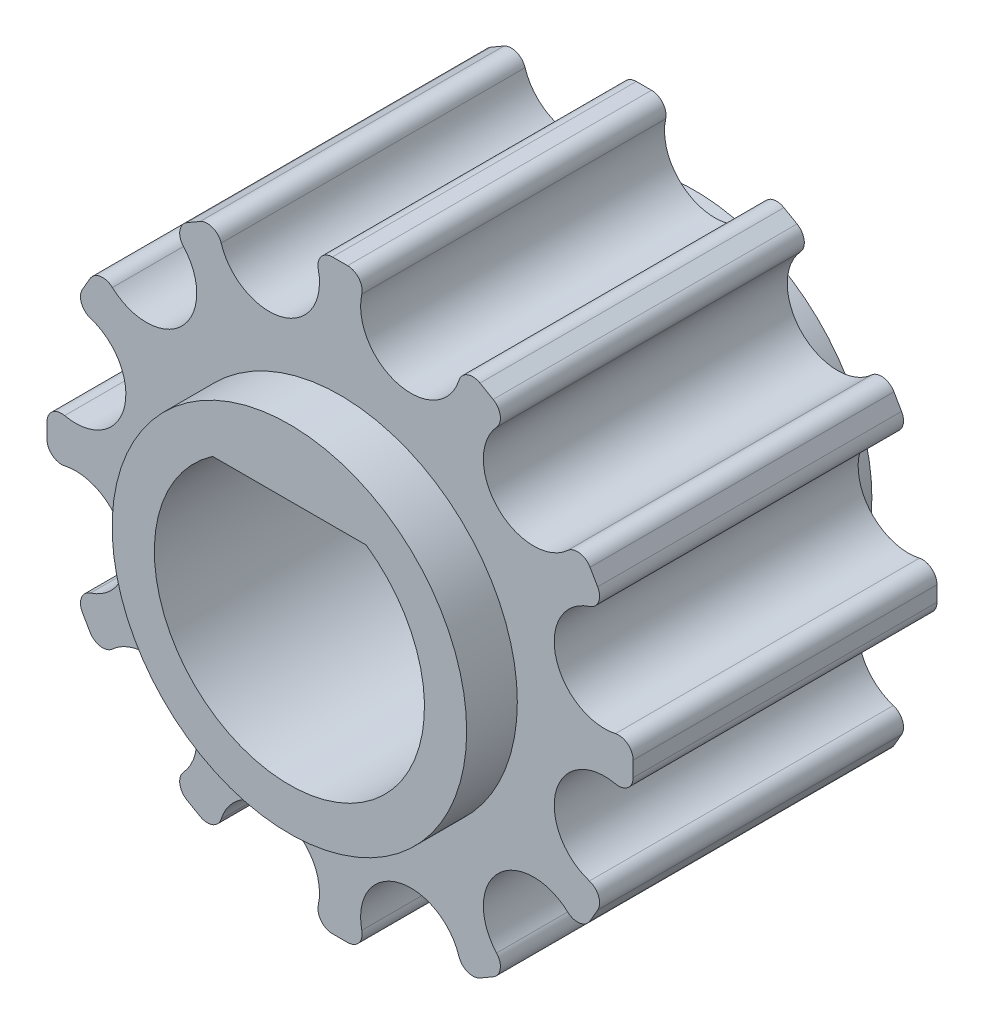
ISO-10303-21;
HEADER;
FILE_DESCRIPTION(('STEP AP214'),'2;1');
FILE_NAME('part.step','',(''),(''),'','','');
FILE_SCHEMA(('AUTOMOTIVE_DESIGN { 1 0 10303 214 1 1 1 1 }'));
ENDSEC;
DATA;
#1=APPLICATION_CONTEXT('core data for automotive mechanical design processes');
#2=APPLICATION_PROTOCOL_DEFINITION('international standard','automotive_design',2000,#1);
#3=PRODUCT_CONTEXT('',#1,'mechanical');
#4=PRODUCT('Part','Part','',(#3));
#5=PRODUCT_RELATED_PRODUCT_CATEGORY('part','',(#4));
#6=PRODUCT_DEFINITION_FORMATION('','',#4);
#7=PRODUCT_DEFINITION_CONTEXT('part definition',#1,'design');
#8=PRODUCT_DEFINITION('design','',#6,#7);
#9=PRODUCT_DEFINITION_SHAPE('','',#8);
#10=(LENGTH_UNIT() NAMED_UNIT(*) SI_UNIT(.MILLI.,.METRE.));
#11=(NAMED_UNIT(*) PLANE_ANGLE_UNIT() SI_UNIT($,.RADIAN.));
#12=(NAMED_UNIT(*) SI_UNIT($,.STERADIAN.) SOLID_ANGLE_UNIT());
#13=UNCERTAINTY_MEASURE_WITH_UNIT(LENGTH_MEASURE(1.E-05),#10,'distance_accuracy_value','');
#14=(GEOMETRIC_REPRESENTATION_CONTEXT(3) GLOBAL_UNCERTAINTY_ASSIGNED_CONTEXT((#13)) GLOBAL_UNIT_ASSIGNED_CONTEXT((#10,
#11,#12)) REPRESENTATION_CONTEXT('',''));
#15=CARTESIAN_POINT('',(0.,0.,0.));
#16=DIRECTION('',(0.,0.,1.));
#17=DIRECTION('',(1.,0.,0.));
#18=AXIS2_PLACEMENT_3D('',#15,#16,#17);
#19=CARTESIAN_POINT('',(0.,0.,-4.5));
#20=DIRECTION('',(0.,0.,1.));
#21=DIRECTION('',(1.,0.,0.));
#22=AXIS2_PLACEMENT_3D('',#19,#20,#21);
#23=PLANE('',#22);
#24=CARTESIAN_POINT('',(-0.2245192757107,8.24929658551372,-4.5));
#25=DIRECTION('',(0.,0.,1.));
#26=DIRECTION('',(1.,0.,0.));
#27=AXIS2_PLACEMENT_3D('',#24,#25,#26);
#28=CIRCLE('',#27,0.430000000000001);
#29=CARTESIAN_POINT('',(-0.2245192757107,8.67929658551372,-4.5));
#30=VERTEX_POINT('',#29);
#31=CARTESIAN_POINT('',(-0.644289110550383,8.15605879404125,-4.5));
#32=VERTEX_POINT('',#31);
#33=EDGE_CURVE('E808',#30,#32,#28,.T.);
#34=ORIENTED_EDGE('',*,*,#33,.F.);
#35=DIRECTION('',(-1.,0.,0.));
#36=VECTOR('',#35,1.);
#37=CARTESIAN_POINT('',(0.,8.67929658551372,-4.5));
#38=LINE('',#37,#36);
#39=CARTESIAN_POINT('',(0.2245192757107,8.67929658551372,-4.5));
#40=VERTEX_POINT('',#39);
#41=EDGE_CURVE('E53',#40,#30,#38,.T.);
#42=ORIENTED_EDGE('',*,*,#41,.F.);
#43=CARTESIAN_POINT('',(0.2245192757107,8.24929658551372,-4.5));
#44=DIRECTION('',(0.,0.,1.));
#45=DIRECTION('',(1.,0.,0.));
#46=AXIS2_PLACEMENT_3D('',#43,#44,#45);
#47=CIRCLE('',#46,0.43);
#48=CARTESIAN_POINT('',(0.644289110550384,8.15605879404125,-4.5));
#49=VERTEX_POINT('',#48);
#50=EDGE_CURVE('E842',#49,#40,#47,.T.);
#51=ORIENTED_EDGE('',*,*,#50,.F.);
#52=CARTESIAN_POINT('',(2.0988403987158,7.83297900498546,-4.5));
#53=DIRECTION('',(0.,0.,1.));
#54=DIRECTION('',(1.,0.,0.));
#55=AXIS2_PLACEMENT_3D('',#52,#53,#54);
#56=CIRCLE('',#55,1.49);
#57=CARTESIAN_POINT('',(3.52005865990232,7.38549866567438,-4.5));
#58=VERTEX_POINT('',#57);
#59=EDGE_CURVE('E68',#58,#49,#56,.F.);
#60=ORIENTED_EDGE('',*,*,#59,.F.);
#61=CARTESIAN_POINT('',(3.93020889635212,7.25636004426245,-4.5));
#62=DIRECTION('',(0.,0.,1.));
#63=DIRECTION('',(1.,0.,0.));
#64=AXIS2_PLACEMENT_3D('',#61,#62,#63);
#65=CIRCLE('',#64,0.430000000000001);
#66=CARTESIAN_POINT('',(4.14520889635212,7.62875096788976,-4.5));
#67=VERTEX_POINT('',#66);
#68=EDGE_CURVE('E848',#67,#58,#65,.T.);
#69=ORIENTED_EDGE('',*,*,#68,.F.);
#70=DIRECTION('',(-0.866025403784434,0.500000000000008,0.));
#71=VECTOR('',#70,1.);
#72=CARTESIAN_POINT('',(4.33964829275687,7.51649133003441,-4.5));
#73=LINE('',#72,#71);
#74=CARTESIAN_POINT('',(4.53408768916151,7.40423169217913,-4.5));
#75=VERTEX_POINT('',#74);
#76=EDGE_CURVE('E851',#75,#67,#73,.T.);
#77=ORIENTED_EDGE('',*,*,#76,.F.);
#78=CARTESIAN_POINT('',(4.31908768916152,7.03184076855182,-4.5));
#79=DIRECTION('',(0.,0.,1.));
#80=DIRECTION('',(1.,0.,0.));
#81=AXIS2_PLACEMENT_3D('',#78,#79,#80);
#82=CIRCLE('',#81,0.43);
#83=CARTESIAN_POINT('',(4.63600013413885,6.74120955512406,-4.5));
#84=VERTEX_POINT('',#83);
#85=EDGE_CURVE('E406',#84,#75,#82,.T.);
#86=ORIENTED_EDGE('',*,*,#85,.F.);
#87=CARTESIAN_POINT('',(5.7341386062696,5.73413860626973,-4.5));
#88=DIRECTION('',(0.,0.,1.));
#89=DIRECTION('',(1.,0.,0.));
#90=AXIS2_PLACEMENT_3D('',#87,#88,#89);
#91=CIRCLE('',#90,1.49);
#92=CARTESIAN_POINT('',(6.74120955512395,4.63600013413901,-4.5));
#93=VERTEX_POINT('',#92);
#94=EDGE_CURVE('E410',#93,#84,#91,.F.);
#95=ORIENTED_EDGE('',*,*,#94,.F.);
#96=CARTESIAN_POINT('',(7.03184076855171,4.31908768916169,-4.5));
#97=DIRECTION('',(0.,0.,1.));
#98=DIRECTION('',(1.,0.,0.));
#99=AXIS2_PLACEMENT_3D('',#96,#97,#98);
#100=CIRCLE('',#99,0.430000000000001);
#101=CARTESIAN_POINT('',(7.40423169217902,4.53408768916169,-4.5));
#102=VERTEX_POINT('',#101);
#103=EDGE_CURVE('E414',#102,#93,#100,.T.);
#104=ORIENTED_EDGE('',*,*,#103,.F.);
#105=DIRECTION('',(-0.50000000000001,0.866025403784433,0.));
#106=VECTOR('',#105,1.);
#107=CARTESIAN_POINT('',(7.51649133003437,4.33964829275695,-4.5));
#108=LINE('',#107,#106);
#109=CARTESIAN_POINT('',(7.62875096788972,4.1452088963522,-4.5));
#110=VERTEX_POINT('',#109);
#111=EDGE_CURVE('E451',#110,#102,#108,.T.);
#112=ORIENTED_EDGE('',*,*,#111,.F.);
#113=CARTESIAN_POINT('',(7.25636004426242,3.9302088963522,-4.5));
#114=DIRECTION('',(0.,0.,1.));
#115=DIRECTION('',(1.,0.,0.));
#116=AXIS2_PLACEMENT_3D('',#113,#114,#115);
#117=CIRCLE('',#116,0.43);
#118=CARTESIAN_POINT('',(7.38549866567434,3.5200586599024,-4.5));
#119=VERTEX_POINT('',#118);
#120=EDGE_CURVE('E441',#119,#110,#117,.T.);
#121=ORIENTED_EDGE('',*,*,#120,.F.);
#122=CARTESIAN_POINT('',(7.83297900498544,2.09884039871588,-4.5));
#123=DIRECTION('',(0.,0.,1.));
#124=DIRECTION('',(1.,0.,0.));
#125=AXIS2_PLACEMENT_3D('',#122,#123,#124);
#126=CIRCLE('',#125,1.49);
#127=CARTESIAN_POINT('',(8.15605879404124,0.644289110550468,-4.5));
#128=VERTEX_POINT('',#127);
#129=EDGE_CURVE('E444',#128,#119,#126,.F.);
#130=ORIENTED_EDGE('',*,*,#129,.F.);
#131=CARTESIAN_POINT('',(8.24929658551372,0.224519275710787,-4.5));
#132=DIRECTION('',(0.,0.,1.));
#133=DIRECTION('',(1.,0.,0.));
#134=AXIS2_PLACEMENT_3D('',#131,#132,#133);
#135=CIRCLE('',#134,0.430000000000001);
#136=CARTESIAN_POINT('',(8.67929658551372,0.224519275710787,-4.5));
#137=VERTEX_POINT('',#136);
#138=EDGE_CURVE('E448',#137,#128,#135,.T.);
#139=ORIENTED_EDGE('',*,*,#138,.F.);
#140=DIRECTION('',(0.,1.,0.));
#141=VECTOR('',#140,1.);
#142=CARTESIAN_POINT('',(8.67929658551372,0.,-4.5));
#143=LINE('',#142,#141);
#144=CARTESIAN_POINT('',(8.67929658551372,-0.224519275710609,-4.5));
#145=VERTEX_POINT('',#144);
#146=EDGE_CURVE('E491',#145,#137,#143,.T.);
#147=ORIENTED_EDGE('',*,*,#146,.F.);
#148=CARTESIAN_POINT('',(8.24929658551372,-0.224519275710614,-4.5));
#149=DIRECTION('',(0.,0.,1.));
#150=DIRECTION('',(1.,0.,0.));
#151=AXIS2_PLACEMENT_3D('',#148,#149,#150);
#152=CIRCLE('',#151,0.43);
#153=CARTESIAN_POINT('',(8.15605879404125,-0.644289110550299,-4.5));
#154=VERTEX_POINT('',#153);
#155=EDGE_CURVE('E481',#154,#145,#152,.T.);
#156=ORIENTED_EDGE('',*,*,#155,.F.);
#157=CARTESIAN_POINT('',(7.83297900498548,-2.09884039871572,-4.5));
#158=DIRECTION('',(0.,0.,1.));
#159=DIRECTION('',(1.,0.,0.));
#160=AXIS2_PLACEMENT_3D('',#157,#158,#159);
#161=CIRCLE('',#160,1.49);
#162=CARTESIAN_POINT('',(7.38549866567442,-3.52005865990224,-4.5));
#163=VERTEX_POINT('',#162);
#164=EDGE_CURVE('E484',#163,#154,#161,.F.);
#165=ORIENTED_EDGE('',*,*,#164,.F.);
#166=CARTESIAN_POINT('',(7.2563600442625,-3.93020889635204,-4.5));
#167=DIRECTION('',(0.,0.,1.));
#168=DIRECTION('',(1.,0.,0.));
#169=AXIS2_PLACEMENT_3D('',#166,#167,#168);
#170=CIRCLE('',#169,0.430000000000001);
#171=CARTESIAN_POINT('',(7.62875096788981,-4.14520889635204,-4.5));
#172=VERTEX_POINT('',#171);
#173=EDGE_CURVE('E488',#172,#163,#170,.T.);
#174=ORIENTED_EDGE('',*,*,#173,.F.);
#175=DIRECTION('',(0.499999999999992,0.866025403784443,0.));
#176=VECTOR('',#175,1.);
#177=CARTESIAN_POINT('',(7.51649133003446,-4.33964829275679,-4.5));
#178=LINE('',#177,#176);
#179=CARTESIAN_POINT('',(7.40423169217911,-4.53408768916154,-4.5));
#180=VERTEX_POINT('',#179);
#181=EDGE_CURVE('E531',#180,#172,#178,.T.);
#182=ORIENTED_EDGE('',*,*,#181,.F.);
#183=CARTESIAN_POINT('',(7.0318407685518,-4.31908768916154,-4.5));
#184=DIRECTION('',(0.,0.,1.));
#185=DIRECTION('',(1.,0.,0.));
#186=AXIS2_PLACEMENT_3D('',#183,#184,#185);
#187=CIRCLE('',#186,0.43);
#188=CARTESIAN_POINT('',(6.74120955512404,-4.63600013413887,-4.5));
#189=VERTEX_POINT('',#188);
#190=EDGE_CURVE('E521',#189,#180,#187,.T.);
#191=ORIENTED_EDGE('',*,*,#190,.F.);
#192=CARTESIAN_POINT('',(5.73413860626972,-5.73413860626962,-4.5));
#193=DIRECTION('',(0.,0.,1.));
#194=DIRECTION('',(1.,0.,0.));
#195=AXIS2_PLACEMENT_3D('',#192,#193,#194);
#196=CIRCLE('',#195,1.49);
#197=CARTESIAN_POINT('',(4.63600013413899,-6.74120955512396,-4.5));
#198=VERTEX_POINT('',#197);
#199=EDGE_CURVE('E524',#198,#189,#196,.F.);
#200=ORIENTED_EDGE('',*,*,#199,.F.);
#201=CARTESIAN_POINT('',(4.31908768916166,-7.03184076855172,-4.5));
#202=DIRECTION('',(0.,0.,1.));
#203=DIRECTION('',(1.,0.,0.));
#204=AXIS2_PLACEMENT_3D('',#201,#202,#203);
#205=CIRCLE('',#204,0.430000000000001);
#206=CARTESIAN_POINT('',(4.53408768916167,-7.40423169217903,-4.5));
#207=VERTEX_POINT('',#206);
#208=EDGE_CURVE('E528',#207,#198,#205,.T.);
#209=ORIENTED_EDGE('',*,*,#208,.F.);
#210=DIRECTION('',(0.866025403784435,0.500000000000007,0.));
#211=VECTOR('',#210,1.);
#212=CARTESIAN_POINT('',(4.33964829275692,-7.51649133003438,-4.5));
#213=LINE('',#212,#211);
#214=CARTESIAN_POINT('',(4.14520889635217,-7.62875096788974,-4.5));
#215=VERTEX_POINT('',#214);
#216=EDGE_CURVE('E571',#215,#207,#213,.T.);
#217=ORIENTED_EDGE('',*,*,#216,.F.);
#218=CARTESIAN_POINT('',(3.93020889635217,-7.25636004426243,-4.5));
#219=DIRECTION('',(0.,0.,1.));
#220=DIRECTION('',(1.,0.,0.));
#221=AXIS2_PLACEMENT_3D('',#218,#219,#220);
#222=CIRCLE('',#221,0.43);
#223=CARTESIAN_POINT('',(3.52005865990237,-7.38549866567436,-4.5));
#224=VERTEX_POINT('',#223);
#225=EDGE_CURVE('E561',#224,#215,#222,.T.);
#226=ORIENTED_EDGE('',*,*,#225,.F.);
#227=CARTESIAN_POINT('',(2.09884039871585,-7.83297900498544,-4.5));
#228=DIRECTION('',(0.,0.,1.));
#229=DIRECTION('',(1.,0.,0.));
#230=AXIS2_PLACEMENT_3D('',#227,#228,#229);
#231=CIRCLE('',#230,1.49);
#232=CARTESIAN_POINT('',(0.644289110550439,-8.15605879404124,-4.5));
#233=VERTEX_POINT('',#232);
#234=EDGE_CURVE('E564',#233,#224,#231,.F.);
#235=ORIENTED_EDGE('',*,*,#234,.F.);
#236=CARTESIAN_POINT('',(0.224519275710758,-8.24929658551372,-4.5));
#237=DIRECTION('',(0.,0.,1.));
#238=DIRECTION('',(1.,0.,0.));
#239=AXIS2_PLACEMENT_3D('',#236,#237,#238);
#240=CIRCLE('',#239,0.430000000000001);
#241=CARTESIAN_POINT('',(0.224519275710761,-8.67929658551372,-4.5));
#242=VERTEX_POINT('',#241);
#243=EDGE_CURVE('E568',#242,#233,#240,.T.);
#244=ORIENTED_EDGE('',*,*,#243,.F.);
#245=DIRECTION('',(1.,0.,0.));
#246=VECTOR('',#245,1.);
#247=CARTESIAN_POINT('',(0.,-8.67929658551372,-4.5));
#248=LINE('',#247,#246);
#249=CARTESIAN_POINT('',(-0.2245192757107,-8.67929658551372,-4.5));
#250=VERTEX_POINT('',#249);
#251=EDGE_CURVE('E611',#250,#242,#248,.T.);
#252=ORIENTED_EDGE('',*,*,#251,.F.);
#253=CARTESIAN_POINT('',(-0.2245192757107,-8.24929658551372,-4.5));
#254=DIRECTION('',(0.,0.,1.));
#255=DIRECTION('',(1.,0.,0.));
#256=AXIS2_PLACEMENT_3D('',#253,#254,#255);
#257=CIRCLE('',#256,0.43);
#258=CARTESIAN_POINT('',(-0.644289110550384,-8.15605879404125,-4.5));
#259=VERTEX_POINT('',#258);
#260=EDGE_CURVE('E601',#259,#250,#257,.T.);
#261=ORIENTED_EDGE('',*,*,#260,.F.);
#262=CARTESIAN_POINT('',(-2.0988403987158,-7.83297900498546,-4.5));
#263=DIRECTION('',(0.,0.,1.));
#264=DIRECTION('',(1.,0.,0.));
#265=AXIS2_PLACEMENT_3D('',#262,#263,#264);
#266=CIRCLE('',#265,1.49);
#267=CARTESIAN_POINT('',(-3.52005865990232,-7.38549866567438,-4.5));
#268=VERTEX_POINT('',#267);
#269=EDGE_CURVE('E604',#268,#259,#266,.F.);
#270=ORIENTED_EDGE('',*,*,#269,.F.);
#271=CARTESIAN_POINT('',(-3.93020889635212,-7.25636004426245,-4.5));
#272=DIRECTION('',(0.,0.,1.));
#273=DIRECTION('',(1.,0.,0.));
#274=AXIS2_PLACEMENT_3D('',#271,#272,#273);
#275=CIRCLE('',#274,0.430000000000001);
#276=CARTESIAN_POINT('',(-4.14520889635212,-7.62875096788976,-4.5));
#277=VERTEX_POINT('',#276);
#278=EDGE_CURVE('E608',#277,#268,#275,.T.);
#279=ORIENTED_EDGE('',*,*,#278,.F.);
#280=DIRECTION('',(0.866025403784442,-0.499999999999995,0.));
#281=VECTOR('',#280,1.);
#282=CARTESIAN_POINT('',(-4.33964829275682,-7.51649133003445,-4.5));
#283=LINE('',#282,#281);
#284=CARTESIAN_POINT('',(-4.53408768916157,-7.4042316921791,-4.5));
#285=VERTEX_POINT('',#284);
#286=EDGE_CURVE('E651',#285,#277,#283,.T.);
#287=ORIENTED_EDGE('',*,*,#286,.F.);
#288=CARTESIAN_POINT('',(-4.31908768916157,-7.03184076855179,-4.5));
#289=DIRECTION('',(0.,0.,1.));
#290=DIRECTION('',(1.,0.,0.));
#291=AXIS2_PLACEMENT_3D('',#288,#289,#290);
#292=CIRCLE('',#291,0.43);
#293=CARTESIAN_POINT('',(-4.6360001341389,-6.74120955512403,-4.5));
#294=VERTEX_POINT('',#293);
#295=EDGE_CURVE('E641',#294,#285,#292,.T.);
#296=ORIENTED_EDGE('',*,*,#295,.F.);
#297=CARTESIAN_POINT('',(-5.73413860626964,-5.7341386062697,-4.5));
#298=DIRECTION('',(0.,0.,1.));
#299=DIRECTION('',(1.,0.,0.));
#300=AXIS2_PLACEMENT_3D('',#297,#298,#299);
#301=CIRCLE('',#300,1.49);
#302=CARTESIAN_POINT('',(-6.74120955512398,-4.63600013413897,-4.5));
#303=VERTEX_POINT('',#302);
#304=EDGE_CURVE('E644',#303,#294,#301,.F.);
#305=ORIENTED_EDGE('',*,*,#304,.F.);
#306=CARTESIAN_POINT('',(-7.03184076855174,-4.31908768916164,-4.5));
#307=DIRECTION('',(0.,0.,1.));
#308=DIRECTION('',(1.,0.,0.));
#309=AXIS2_PLACEMENT_3D('',#306,#307,#308);
#310=CIRCLE('',#309,0.430000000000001);
#311=CARTESIAN_POINT('',(-7.40423169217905,-4.53408768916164,-4.5));
#312=VERTEX_POINT('',#311);
#313=EDGE_CURVE('E648',#312,#303,#310,.T.);
#314=ORIENTED_EDGE('',*,*,#313,.F.);
#315=DIRECTION('',(0.500000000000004,-0.866025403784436,0.));
#316=VECTOR('',#315,1.);
#317=CARTESIAN_POINT('',(-7.5164913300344,-4.3396482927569,-4.5));
#318=LINE('',#317,#316);
#319=CARTESIAN_POINT('',(-7.62875096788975,-4.14520889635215,-4.5));
#320=VERTEX_POINT('',#319);
#321=EDGE_CURVE('E691',#320,#312,#318,.T.);
#322=ORIENTED_EDGE('',*,*,#321,.F.);
#323=CARTESIAN_POINT('',(-7.25636004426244,-3.93020889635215,-4.5));
#324=DIRECTION('',(0.,0.,1.));
#325=DIRECTION('',(1.,0.,0.));
#326=AXIS2_PLACEMENT_3D('',#323,#324,#325);
#327=CIRCLE('',#326,0.43);
#328=CARTESIAN_POINT('',(-7.38549866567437,-3.52005865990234,-4.5));
#329=VERTEX_POINT('',#328);
#330=EDGE_CURVE('E681',#329,#320,#327,.T.);
#331=ORIENTED_EDGE('',*,*,#330,.F.);
#332=CARTESIAN_POINT('',(-7.83297900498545,-2.09884039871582,-4.5));
#333=DIRECTION('',(0.,0.,1.));
#334=DIRECTION('',(1.,0.,0.));
#335=AXIS2_PLACEMENT_3D('',#332,#333,#334);
#336=CIRCLE('',#335,1.49);
#337=CARTESIAN_POINT('',(-8.15605879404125,-0.644289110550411,-4.5));
#338=VERTEX_POINT('',#337);
#339=EDGE_CURVE('E684',#338,#329,#336,.F.);
#340=ORIENTED_EDGE('',*,*,#339,.F.);
#341=CARTESIAN_POINT('',(-8.24929658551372,-0.224519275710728,-4.5));
#342=DIRECTION('',(0.,0.,1.));
#343=DIRECTION('',(1.,0.,0.));
#344=AXIS2_PLACEMENT_3D('',#341,#342,#343);
#345=CIRCLE('',#344,0.430000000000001);
#346=CARTESIAN_POINT('',(-8.67929658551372,-0.22451927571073,-4.5));
#347=VERTEX_POINT('',#346);
#348=EDGE_CURVE('E688',#347,#338,#345,.T.);
#349=ORIENTED_EDGE('',*,*,#348,.F.);
#350=DIRECTION('',(0.,-1.,0.));
#351=VECTOR('',#350,1.);
#352=CARTESIAN_POINT('',(-8.67929658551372,0.,-4.5));
#353=LINE('',#352,#351);
#354=CARTESIAN_POINT('',(-8.67929658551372,0.22451927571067,-4.5));
#355=VERTEX_POINT('',#354);
#356=EDGE_CURVE('E731',#355,#347,#353,.T.);
#357=ORIENTED_EDGE('',*,*,#356,.F.);
#358=CARTESIAN_POINT('',(-8.24929658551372,0.224519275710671,-4.5));
#359=DIRECTION('',(0.,0.,1.));
#360=DIRECTION('',(1.,0.,0.));
#361=AXIS2_PLACEMENT_3D('',#358,#359,#360);
#362=CIRCLE('',#361,0.43);
#363=CARTESIAN_POINT('',(-8.15605879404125,0.644289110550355,-4.5));
#364=VERTEX_POINT('',#363);
#365=EDGE_CURVE('E721',#364,#355,#362,.T.);
#366=ORIENTED_EDGE('',*,*,#365,.F.);
#367=CARTESIAN_POINT('',(-7.83297900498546,2.09884039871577,-4.5));
#368=DIRECTION('',(0.,0.,1.));
#369=DIRECTION('',(1.,0.,0.));
#370=AXIS2_PLACEMENT_3D('',#367,#368,#369);
#371=CIRCLE('',#370,1.49);
#372=CARTESIAN_POINT('',(-7.38549866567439,3.52005865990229,-4.5));
#373=VERTEX_POINT('',#372);
#374=EDGE_CURVE('E724',#373,#364,#371,.F.);
#375=ORIENTED_EDGE('',*,*,#374,.F.);
#376=CARTESIAN_POINT('',(-7.25636004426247,3.93020889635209,-4.5));
#377=DIRECTION('',(0.,0.,1.));
#378=DIRECTION('',(1.,0.,0.));
#379=AXIS2_PLACEMENT_3D('',#376,#377,#378);
#380=CIRCLE('',#379,0.430000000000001);
#381=CARTESIAN_POINT('',(-7.62875096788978,4.14520889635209,-4.5));
#382=VERTEX_POINT('',#381);
#383=EDGE_CURVE('E728',#382,#373,#380,.T.);
#384=ORIENTED_EDGE('',*,*,#383,.F.);
#385=DIRECTION('',(-0.499999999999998,-0.86602540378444,0.));
#386=VECTOR('',#385,1.);
#387=CARTESIAN_POINT('',(-7.51649133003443,4.33964829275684,-4.5));
#388=LINE('',#387,#386);
#389=CARTESIAN_POINT('',(-7.40423169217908,4.53408768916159,-4.5));
#390=VERTEX_POINT('',#389);
#391=EDGE_CURVE('E771',#390,#382,#388,.T.);
#392=ORIENTED_EDGE('',*,*,#391,.F.);
#393=CARTESIAN_POINT('',(-7.03184076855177,4.31908768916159,-4.5));
#394=DIRECTION('',(0.,0.,1.));
#395=DIRECTION('',(1.,0.,0.));
#396=AXIS2_PLACEMENT_3D('',#393,#394,#395);
#397=CIRCLE('',#396,0.43);
#398=CARTESIAN_POINT('',(-6.74120955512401,4.63600013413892,-4.5));
#399=VERTEX_POINT('',#398);
#400=EDGE_CURVE('E761',#399,#390,#397,.T.);
#401=ORIENTED_EDGE('',*,*,#400,.F.);
#402=CARTESIAN_POINT('',(-5.73413860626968,5.73413860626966,-4.5));
#403=DIRECTION('',(0.,0.,1.));
#404=DIRECTION('',(1.,0.,0.));
#405=AXIS2_PLACEMENT_3D('',#402,#403,#404);
#406=CIRCLE('',#405,1.49);
#407=CARTESIAN_POINT('',(-4.63600013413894,6.741209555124,-4.5));
#408=VERTEX_POINT('',#407);
#409=EDGE_CURVE('E764',#408,#399,#406,.F.);
#410=ORIENTED_EDGE('',*,*,#409,.F.);
#411=CARTESIAN_POINT('',(-4.31908768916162,7.03184076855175,-4.5));
#412=DIRECTION('',(0.,0.,1.));
#413=DIRECTION('',(1.,0.,0.));
#414=AXIS2_PLACEMENT_3D('',#411,#412,#413);
#415=CIRCLE('',#414,0.430000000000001);
#416=CARTESIAN_POINT('',(-4.53408768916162,7.40423169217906,-4.5));
#417=VERTEX_POINT('',#416);
#418=EDGE_CURVE('E768',#417,#408,#415,.T.);
#419=ORIENTED_EDGE('',*,*,#418,.F.);
#420=DIRECTION('',(-0.866025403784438,-0.500000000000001,0.));
#421=VECTOR('',#420,1.);
#422=CARTESIAN_POINT('',(-4.33964829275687,7.51649133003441,-4.5));
#423=LINE('',#422,#421);
#424=CARTESIAN_POINT('',(-4.14520889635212,7.62875096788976,-4.5));
#425=VERTEX_POINT('',#424);
#426=EDGE_CURVE('E811',#425,#417,#423,.T.);
#427=ORIENTED_EDGE('',*,*,#426,.F.);
#428=CARTESIAN_POINT('',(-3.93020889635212,7.25636004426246,-4.5));
#429=DIRECTION('',(0.,0.,1.));
#430=DIRECTION('',(1.,0.,0.));
#431=AXIS2_PLACEMENT_3D('',#428,#429,#430);
#432=CIRCLE('',#431,0.43);
#433=CARTESIAN_POINT('',(-3.52005865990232,7.38549866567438,-4.5));
#434=VERTEX_POINT('',#433);
#435=EDGE_CURVE('E801',#434,#425,#432,.T.);
#436=ORIENTED_EDGE('',*,*,#435,.F.);
#437=CARTESIAN_POINT('',(-2.0988403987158,7.83297900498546,-4.5));
#438=DIRECTION('',(0.,0.,1.));
#439=DIRECTION('',(1.,0.,0.));
#440=AXIS2_PLACEMENT_3D('',#437,#438,#439);
#441=CIRCLE('',#440,1.49);
#442=EDGE_CURVE('E804',#32,#434,#441,.F.);
#443=ORIENTED_EDGE('',*,*,#442,.F.);
#444=EDGE_LOOP('',(#34,#42,#51,#60,#69,#77,#86,#95,#104,#112,#121,#130,#139,#147,#156,#165,#174,
#182,#191,#200,#209,#217,#226,#235,#244,#252,#261,#270,#279,#287,#296,#305,#314,#322,#331,#340,
#349,#357,#366,#375,#384,#392,#401,#410,#419,#427,#436,#443));
#445=FACE_BOUND('',#444,.T.);
#446=CARTESIAN_POINT('',(0.,0.,-4.5));
#447=DIRECTION('',(0.,0.,1.));
#448=DIRECTION('',(1.,0.,0.));
#449=AXIS2_PLACEMENT_3D('',#446,#447,#448);
#450=CIRCLE('',#449,5.25);
#451=CARTESIAN_POINT('',(5.25,0.,-4.5));
#452=VERTEX_POINT('',#451);
#453=EDGE_CURVE('E11',#452,#452,#450,.F.);
#454=ORIENTED_EDGE('',*,*,#453,.F.);
#455=EDGE_LOOP('',(#454));
#456=FACE_BOUND('',#455,.T.);
#457=ADVANCED_FACE('F45',(#445,#456),#23,.F.);
#458=CARTESIAN_POINT('',(0.,0.,4.5));
#459=DIRECTION('',(0.,0.,1.));
#460=DIRECTION('',(1.,0.,0.));
#461=AXIS2_PLACEMENT_3D('',#458,#459,#460);
#462=PLANE('',#461);
#463=DIRECTION('',(1.,0.,0.));
#464=VECTOR('',#463,1.);
#465=CARTESIAN_POINT('',(0.,8.67929658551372,4.5));
#466=LINE('',#465,#464);
#467=CARTESIAN_POINT('',(-0.2245192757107,8.67929658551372,4.5));
#468=VERTEX_POINT('',#467);
#469=CARTESIAN_POINT('',(0.2245192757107,8.67929658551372,4.5));
#470=VERTEX_POINT('',#469);
#471=EDGE_CURVE('E841',#468,#470,#466,.T.);
#472=ORIENTED_EDGE('',*,*,#471,.F.);
#473=CARTESIAN_POINT('',(-0.2245192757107,8.24929658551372,4.5));
#474=DIRECTION('',(0.,0.,-1.));
#475=DIRECTION('',(0.866025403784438,0.500000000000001,0.));
#476=AXIS2_PLACEMENT_3D('',#473,#474,#475);
#477=CIRCLE('',#476,0.430000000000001);
#478=CARTESIAN_POINT('',(-0.644289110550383,8.15605879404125,4.5));
#479=VERTEX_POINT('',#478);
#480=EDGE_CURVE('E823',#479,#468,#477,.T.);
#481=ORIENTED_EDGE('',*,*,#480,.F.);
#482=CARTESIAN_POINT('',(-2.0988403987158,7.83297900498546,4.5));
#483=DIRECTION('',(0.,0.,1.));
#484=DIRECTION('',(0.866025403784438,0.500000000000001,0.));
#485=AXIS2_PLACEMENT_3D('',#482,#483,#484);
#486=CIRCLE('',#485,1.49);
#487=CARTESIAN_POINT('',(-3.52005865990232,7.38549866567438,4.5));
#488=VERTEX_POINT('',#487);
#489=EDGE_CURVE('E819',#488,#479,#486,.T.);
#490=ORIENTED_EDGE('',*,*,#489,.F.);
#491=CARTESIAN_POINT('',(-3.93020889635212,7.25636004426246,4.5));
#492=DIRECTION('',(0.,0.,-1.));
#493=DIRECTION('',(-0.866025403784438,-0.500000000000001,0.));
#494=AXIS2_PLACEMENT_3D('',#491,#492,#493);
#495=CIRCLE('',#494,0.43);
#496=CARTESIAN_POINT('',(-4.14520889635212,7.62875096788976,4.5));
#497=VERTEX_POINT('',#496);
#498=EDGE_CURVE('E815',#497,#488,#495,.T.);
#499=ORIENTED_EDGE('',*,*,#498,.F.);
#500=DIRECTION('',(0.866025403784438,0.500000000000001,0.));
#501=VECTOR('',#500,1.);
#502=CARTESIAN_POINT('',(-4.33964829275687,7.51649133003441,4.5));
#503=LINE('',#502,#501);
#504=CARTESIAN_POINT('',(-4.53408768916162,7.40423169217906,4.5));
#505=VERTEX_POINT('',#504);
#506=EDGE_CURVE('E800',#505,#497,#503,.T.);
#507=ORIENTED_EDGE('',*,*,#506,.F.);
#508=CARTESIAN_POINT('',(-4.31908768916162,7.03184076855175,4.5));
#509=DIRECTION('',(0.,0.,-1.));
#510=DIRECTION('',(0.499999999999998,0.86602540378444,0.));
#511=AXIS2_PLACEMENT_3D('',#508,#509,#510);
#512=CIRCLE('',#511,0.430000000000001);
#513=CARTESIAN_POINT('',(-4.63600013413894,6.741209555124,4.5));
#514=VERTEX_POINT('',#513);
#515=EDGE_CURVE('E783',#514,#505,#512,.T.);
#516=ORIENTED_EDGE('',*,*,#515,.F.);
#517=CARTESIAN_POINT('',(-5.73413860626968,5.73413860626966,4.5));
#518=DIRECTION('',(0.,0.,1.));
#519=DIRECTION('',(0.499999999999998,0.86602540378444,0.));
#520=AXIS2_PLACEMENT_3D('',#517,#518,#519);
#521=CIRCLE('',#520,1.49);
#522=CARTESIAN_POINT('',(-6.74120955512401,4.63600013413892,4.5));
#523=VERTEX_POINT('',#522);
#524=EDGE_CURVE('E779',#523,#514,#521,.T.);
#525=ORIENTED_EDGE('',*,*,#524,.F.);
#526=CARTESIAN_POINT('',(-7.03184076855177,4.31908768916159,4.5));
#527=DIRECTION('',(0.,0.,-1.));
#528=DIRECTION('',(-0.499999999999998,-0.86602540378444,0.));
#529=AXIS2_PLACEMENT_3D('',#526,#527,#528);
#530=CIRCLE('',#529,0.43);
#531=CARTESIAN_POINT('',(-7.40423169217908,4.53408768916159,4.5));
#532=VERTEX_POINT('',#531);
#533=EDGE_CURVE('E775',#532,#523,#530,.T.);
#534=ORIENTED_EDGE('',*,*,#533,.F.);
#535=DIRECTION('',(0.499999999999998,0.86602540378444,0.));
#536=VECTOR('',#535,1.);
#537=CARTESIAN_POINT('',(-7.51649133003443,4.33964829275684,4.5));
#538=LINE('',#537,#536);
#539=CARTESIAN_POINT('',(-7.62875096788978,4.14520889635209,4.5));
#540=VERTEX_POINT('',#539);
#541=EDGE_CURVE('E760',#540,#532,#538,.T.);
#542=ORIENTED_EDGE('',*,*,#541,.F.);
#543=CARTESIAN_POINT('',(-7.25636004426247,3.93020889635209,4.5));
#544=DIRECTION('',(0.,0.,-1.));
#545=DIRECTION('',(0.,1.,0.));
#546=AXIS2_PLACEMENT_3D('',#543,#544,#545);
#547=CIRCLE('',#546,0.430000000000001);
#548=CARTESIAN_POINT('',(-7.38549866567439,3.52005865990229,4.5));
#549=VERTEX_POINT('',#548);
#550=EDGE_CURVE('E743',#549,#540,#547,.T.);
#551=ORIENTED_EDGE('',*,*,#550,.F.);
#552=CARTESIAN_POINT('',(-7.83297900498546,2.09884039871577,4.5));
#553=DIRECTION('',(0.,0.,1.));
#554=DIRECTION('',(0.,1.,0.));
#555=AXIS2_PLACEMENT_3D('',#552,#553,#554);
#556=CIRCLE('',#555,1.49);
#557=CARTESIAN_POINT('',(-8.15605879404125,0.644289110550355,4.5));
#558=VERTEX_POINT('',#557);
#559=EDGE_CURVE('E739',#558,#549,#556,.T.);
#560=ORIENTED_EDGE('',*,*,#559,.F.);
#561=CARTESIAN_POINT('',(-8.24929658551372,0.224519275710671,4.5));
#562=DIRECTION('',(0.,0.,-1.));
#563=DIRECTION('',(0.,-1.,0.));
#564=AXIS2_PLACEMENT_3D('',#561,#562,#563);
#565=CIRCLE('',#564,0.43);
#566=CARTESIAN_POINT('',(-8.67929658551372,0.22451927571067,4.5));
#567=VERTEX_POINT('',#566);
#568=EDGE_CURVE('E735',#567,#558,#565,.T.);
#569=ORIENTED_EDGE('',*,*,#568,.F.);
#570=DIRECTION('',(0.,1.,0.));
#571=VECTOR('',#570,1.);
#572=CARTESIAN_POINT('',(-8.67929658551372,0.,4.5));
#573=LINE('',#572,#571);
#574=CARTESIAN_POINT('',(-8.67929658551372,-0.22451927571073,4.5));
#575=VERTEX_POINT('',#574);
#576=EDGE_CURVE('E720',#575,#567,#573,.T.);
#577=ORIENTED_EDGE('',*,*,#576,.F.);
#578=CARTESIAN_POINT('',(-8.24929658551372,-0.224519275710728,4.5));
#579=DIRECTION('',(0.,0.,-1.));
#580=DIRECTION('',(-0.500000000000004,0.866025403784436,0.));
#581=AXIS2_PLACEMENT_3D('',#578,#579,#580);
#582=CIRCLE('',#581,0.430000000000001);
#583=CARTESIAN_POINT('',(-8.15605879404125,-0.644289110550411,4.5));
#584=VERTEX_POINT('',#583);
#585=EDGE_CURVE('E703',#584,#575,#582,.T.);
#586=ORIENTED_EDGE('',*,*,#585,.F.);
#587=CARTESIAN_POINT('',(-7.83297900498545,-2.09884039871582,4.5));
#588=DIRECTION('',(0.,0.,1.));
#589=DIRECTION('',(-0.500000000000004,0.866025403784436,0.));
#590=AXIS2_PLACEMENT_3D('',#587,#588,#589);
#591=CIRCLE('',#590,1.49);
#592=CARTESIAN_POINT('',(-7.38549866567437,-3.52005865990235,4.5));
#593=VERTEX_POINT('',#592);
#594=EDGE_CURVE('E699',#593,#584,#591,.T.);
#595=ORIENTED_EDGE('',*,*,#594,.F.);
#596=CARTESIAN_POINT('',(-7.25636004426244,-3.93020889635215,4.5));
#597=DIRECTION('',(0.,0.,-1.));
#598=DIRECTION('',(0.500000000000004,-0.866025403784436,0.));
#599=AXIS2_PLACEMENT_3D('',#596,#597,#598);
#600=CIRCLE('',#599,0.43);
#601=CARTESIAN_POINT('',(-7.62875096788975,-4.14520889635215,4.5));
#602=VERTEX_POINT('',#601);
#603=EDGE_CURVE('E695',#602,#593,#600,.T.);
#604=ORIENTED_EDGE('',*,*,#603,.F.);
#605=DIRECTION('',(-0.500000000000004,0.866025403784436,0.));
#606=VECTOR('',#605,1.);
#607=CARTESIAN_POINT('',(-7.5164913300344,-4.3396482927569,4.5));
#608=LINE('',#607,#606);
#609=CARTESIAN_POINT('',(-7.40423169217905,-4.53408768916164,4.5));
#610=VERTEX_POINT('',#609);
#611=EDGE_CURVE('E680',#610,#602,#608,.T.);
#612=ORIENTED_EDGE('',*,*,#611,.F.);
#613=CARTESIAN_POINT('',(-7.03184076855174,-4.31908768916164,4.5));
#614=DIRECTION('',(0.,0.,-1.));
#615=DIRECTION('',(-0.866025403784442,0.499999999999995,0.));
#616=AXIS2_PLACEMENT_3D('',#613,#614,#615);
#617=CIRCLE('',#616,0.430000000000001);
#618=CARTESIAN_POINT('',(-6.74120955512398,-4.63600013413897,4.5));
#619=VERTEX_POINT('',#618);
#620=EDGE_CURVE('E663',#619,#610,#617,.T.);
#621=ORIENTED_EDGE('',*,*,#620,.F.);
#622=CARTESIAN_POINT('',(-5.73413860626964,-5.7341386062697,4.5));
#623=DIRECTION('',(0.,0.,1.));
#624=DIRECTION('',(-0.866025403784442,0.499999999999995,0.));
#625=AXIS2_PLACEMENT_3D('',#622,#623,#624);
#626=CIRCLE('',#625,1.49);
#627=CARTESIAN_POINT('',(-4.6360001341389,-6.74120955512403,4.5));
#628=VERTEX_POINT('',#627);
#629=EDGE_CURVE('E659',#628,#619,#626,.T.);
#630=ORIENTED_EDGE('',*,*,#629,.F.);
#631=CARTESIAN_POINT('',(-4.31908768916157,-7.03184076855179,4.5));
#632=DIRECTION('',(0.,0.,-1.));
#633=DIRECTION('',(0.866025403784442,-0.499999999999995,0.));
#634=AXIS2_PLACEMENT_3D('',#631,#632,#633);
#635=CIRCLE('',#634,0.43);
#636=CARTESIAN_POINT('',(-4.53408768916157,-7.4042316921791,4.5));
#637=VERTEX_POINT('',#636);
#638=EDGE_CURVE('E655',#637,#628,#635,.T.);
#639=ORIENTED_EDGE('',*,*,#638,.F.);
#640=DIRECTION('',(-0.866025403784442,0.499999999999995,0.));
#641=VECTOR('',#640,1.);
#642=CARTESIAN_POINT('',(-4.33964829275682,-7.51649133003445,4.5));
#643=LINE('',#642,#641);
#644=CARTESIAN_POINT('',(-4.14520889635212,-7.62875096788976,4.5));
#645=VERTEX_POINT('',#644);
#646=EDGE_CURVE('E640',#645,#637,#643,.T.);
#647=ORIENTED_EDGE('',*,*,#646,.F.);
#648=CARTESIAN_POINT('',(-3.93020889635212,-7.25636004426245,4.5));
#649=DIRECTION('',(0.,0.,-1.));
#650=DIRECTION('',(-1.,0.,0.));
#651=AXIS2_PLACEMENT_3D('',#648,#649,#650);
#652=CIRCLE('',#651,0.430000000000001);
#653=CARTESIAN_POINT('',(-3.52005865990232,-7.38549866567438,4.5));
#654=VERTEX_POINT('',#653);
#655=EDGE_CURVE('E623',#654,#645,#652,.T.);
#656=ORIENTED_EDGE('',*,*,#655,.F.);
#657=CARTESIAN_POINT('',(-2.0988403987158,-7.83297900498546,4.5));
#658=DIRECTION('',(0.,0.,1.));
#659=DIRECTION('',(-1.,0.,0.));
#660=AXIS2_PLACEMENT_3D('',#657,#658,#659);
#661=CIRCLE('',#660,1.49);
#662=CARTESIAN_POINT('',(-0.644289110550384,-8.15605879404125,4.5));
#663=VERTEX_POINT('',#662);
#664=EDGE_CURVE('E619',#663,#654,#661,.T.);
#665=ORIENTED_EDGE('',*,*,#664,.F.);
#666=CARTESIAN_POINT('',(-0.2245192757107,-8.24929658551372,4.5));
#667=DIRECTION('',(0.,0.,-1.));
#668=DIRECTION('',(1.,0.,0.));
#669=AXIS2_PLACEMENT_3D('',#666,#667,#668);
#670=CIRCLE('',#669,0.43);
#671=CARTESIAN_POINT('',(-0.2245192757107,-8.67929658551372,4.5));
#672=VERTEX_POINT('',#671);
#673=EDGE_CURVE('E615',#672,#663,#670,.T.);
#674=ORIENTED_EDGE('',*,*,#673,.F.);
#675=DIRECTION('',(-1.,0.,0.));
#676=VECTOR('',#675,1.);
#677=CARTESIAN_POINT('',(0.,-8.67929658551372,4.5));
#678=LINE('',#677,#676);
#679=CARTESIAN_POINT('',(0.224519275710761,-8.67929658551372,4.5));
#680=VERTEX_POINT('',#679);
#681=EDGE_CURVE('E600',#680,#672,#678,.T.);
#682=ORIENTED_EDGE('',*,*,#681,.F.);
#683=CARTESIAN_POINT('',(0.224519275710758,-8.24929658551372,4.5));
#684=DIRECTION('',(0.,0.,-1.));
#685=DIRECTION('',(-0.866025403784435,-0.500000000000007,0.));
#686=AXIS2_PLACEMENT_3D('',#683,#684,#685);
#687=CIRCLE('',#686,0.430000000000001);
#688=CARTESIAN_POINT('',(0.64428911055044,-8.15605879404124,4.5));
#689=VERTEX_POINT('',#688);
#690=EDGE_CURVE('E583',#689,#680,#687,.T.);
#691=ORIENTED_EDGE('',*,*,#690,.F.);
#692=CARTESIAN_POINT('',(2.09884039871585,-7.83297900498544,4.5));
#693=DIRECTION('',(0.,0.,1.));
#694=DIRECTION('',(-0.866025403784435,-0.500000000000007,0.));
#695=AXIS2_PLACEMENT_3D('',#692,#693,#694);
#696=CIRCLE('',#695,1.49);
#697=CARTESIAN_POINT('',(3.52005865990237,-7.38549866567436,4.5));
#698=VERTEX_POINT('',#697);
#699=EDGE_CURVE('E579',#698,#689,#696,.T.);
#700=ORIENTED_EDGE('',*,*,#699,.F.);
#701=CARTESIAN_POINT('',(3.93020889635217,-7.25636004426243,4.5));
#702=DIRECTION('',(0.,0.,-1.));
#703=DIRECTION('',(0.866025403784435,0.500000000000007,0.));
#704=AXIS2_PLACEMENT_3D('',#701,#702,#703);
#705=CIRCLE('',#704,0.43);
#706=CARTESIAN_POINT('',(4.14520889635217,-7.62875096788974,4.5));
#707=VERTEX_POINT('',#706);
#708=EDGE_CURVE('E575',#707,#698,#705,.T.);
#709=ORIENTED_EDGE('',*,*,#708,.F.);
#710=DIRECTION('',(-0.866025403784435,-0.500000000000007,0.));
#711=VECTOR('',#710,1.);
#712=CARTESIAN_POINT('',(4.33964829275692,-7.51649133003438,4.5));
#713=LINE('',#712,#711);
#714=CARTESIAN_POINT('',(4.53408768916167,-7.40423169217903,4.5));
#715=VERTEX_POINT('',#714);
#716=EDGE_CURVE('E560',#715,#707,#713,.T.);
#717=ORIENTED_EDGE('',*,*,#716,.F.);
#718=CARTESIAN_POINT('',(4.31908768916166,-7.03184076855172,4.5));
#719=DIRECTION('',(0.,0.,-1.));
#720=DIRECTION('',(-0.499999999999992,-0.866025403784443,0.));
#721=AXIS2_PLACEMENT_3D('',#718,#719,#720);
#722=CIRCLE('',#721,0.430000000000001);
#723=CARTESIAN_POINT('',(4.63600013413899,-6.74120955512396,4.5));
#724=VERTEX_POINT('',#723);
#725=EDGE_CURVE('E543',#724,#715,#722,.T.);
#726=ORIENTED_EDGE('',*,*,#725,.F.);
#727=CARTESIAN_POINT('',(5.73413860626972,-5.73413860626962,4.5));
#728=DIRECTION('',(0.,0.,1.));
#729=DIRECTION('',(-0.499999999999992,-0.866025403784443,0.));
#730=AXIS2_PLACEMENT_3D('',#727,#728,#729);
#731=CIRCLE('',#730,1.49);
#732=CARTESIAN_POINT('',(6.74120955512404,-4.63600013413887,4.5));
#733=VERTEX_POINT('',#732);
#734=EDGE_CURVE('E539',#733,#724,#731,.T.);
#735=ORIENTED_EDGE('',*,*,#734,.F.);
#736=CARTESIAN_POINT('',(7.0318407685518,-4.31908768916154,4.5));
#737=DIRECTION('',(0.,0.,-1.));
#738=DIRECTION('',(0.499999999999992,0.866025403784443,0.));
#739=AXIS2_PLACEMENT_3D('',#736,#737,#738);
#740=CIRCLE('',#739,0.43);
#741=CARTESIAN_POINT('',(7.40423169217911,-4.53408768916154,4.5));
#742=VERTEX_POINT('',#741);
#743=EDGE_CURVE('E535',#742,#733,#740,.T.);
#744=ORIENTED_EDGE('',*,*,#743,.F.);
#745=DIRECTION('',(-0.499999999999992,-0.866025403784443,0.));
#746=VECTOR('',#745,1.);
#747=CARTESIAN_POINT('',(7.51649133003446,-4.33964829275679,4.5));
#748=LINE('',#747,#746);
#749=CARTESIAN_POINT('',(7.62875096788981,-4.14520889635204,4.5));
#750=VERTEX_POINT('',#749);
#751=EDGE_CURVE('E520',#750,#742,#748,.T.);
#752=ORIENTED_EDGE('',*,*,#751,.F.);
#753=CARTESIAN_POINT('',(7.2563600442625,-3.93020889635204,4.5));
#754=DIRECTION('',(0.,0.,-1.));
#755=DIRECTION('',(0.,-1.,0.));
#756=AXIS2_PLACEMENT_3D('',#753,#754,#755);
#757=CIRCLE('',#756,0.430000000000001);
#758=CARTESIAN_POINT('',(7.38549866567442,-3.52005865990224,4.5));
#759=VERTEX_POINT('',#758);
#760=EDGE_CURVE('E503',#759,#750,#757,.T.);
#761=ORIENTED_EDGE('',*,*,#760,.F.);
#762=CARTESIAN_POINT('',(7.83297900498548,-2.09884039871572,4.5));
#763=DIRECTION('',(0.,0.,1.));
#764=DIRECTION('',(0.,-1.,0.));
#765=AXIS2_PLACEMENT_3D('',#762,#763,#764);
#766=CIRCLE('',#765,1.49);
#767=CARTESIAN_POINT('',(8.15605879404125,-0.644289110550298,4.5));
#768=VERTEX_POINT('',#767);
#769=EDGE_CURVE('E499',#768,#759,#766,.T.);
#770=ORIENTED_EDGE('',*,*,#769,.F.);
#771=CARTESIAN_POINT('',(8.24929658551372,-0.224519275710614,4.5));
#772=DIRECTION('',(0.,0.,-1.));
#773=DIRECTION('',(0.,1.,0.));
#774=AXIS2_PLACEMENT_3D('',#771,#772,#773);
#775=CIRCLE('',#774,0.43);
#776=CARTESIAN_POINT('',(8.67929658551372,-0.224519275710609,4.5));
#777=VERTEX_POINT('',#776);
#778=EDGE_CURVE('E495',#777,#768,#775,.T.);
#779=ORIENTED_EDGE('',*,*,#778,.F.);
#780=DIRECTION('',(0.,-1.,0.));
#781=VECTOR('',#780,1.);
#782=CARTESIAN_POINT('',(8.67929658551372,0.,4.5));
#783=LINE('',#782,#781);
#784=CARTESIAN_POINT('',(8.67929658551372,0.224519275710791,4.5));
#785=VERTEX_POINT('',#784);
#786=EDGE_CURVE('E480',#785,#777,#783,.T.);
#787=ORIENTED_EDGE('',*,*,#786,.F.);
#788=CARTESIAN_POINT('',(8.24929658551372,0.224519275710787,4.5));
#789=DIRECTION('',(0.,0.,-1.));
#790=DIRECTION('',(0.50000000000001,-0.866025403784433,0.));
#791=AXIS2_PLACEMENT_3D('',#788,#789,#790);
#792=CIRCLE('',#791,0.430000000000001);
#793=CARTESIAN_POINT('',(8.15605879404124,0.644289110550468,4.5));
#794=VERTEX_POINT('',#793);
#795=EDGE_CURVE('E463',#794,#785,#792,.T.);
#796=ORIENTED_EDGE('',*,*,#795,.F.);
#797=CARTESIAN_POINT('',(7.83297900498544,2.09884039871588,4.5));
#798=DIRECTION('',(0.,0.,1.));
#799=DIRECTION('',(0.50000000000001,-0.866025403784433,0.));
#800=AXIS2_PLACEMENT_3D('',#797,#798,#799);
#801=CIRCLE('',#800,1.49);
#802=CARTESIAN_POINT('',(7.38549866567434,3.5200586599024,4.5));
#803=VERTEX_POINT('',#802);
#804=EDGE_CURVE('E459',#803,#794,#801,.T.);
#805=ORIENTED_EDGE('',*,*,#804,.F.);
#806=CARTESIAN_POINT('',(7.25636004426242,3.9302088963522,4.5));
#807=DIRECTION('',(0.,0.,-1.));
#808=DIRECTION('',(-0.50000000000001,0.866025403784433,0.));
#809=AXIS2_PLACEMENT_3D('',#806,#807,#808);
#810=CIRCLE('',#809,0.43);
#811=CARTESIAN_POINT('',(7.62875096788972,4.1452088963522,4.5));
#812=VERTEX_POINT('',#811);
#813=EDGE_CURVE('E455',#812,#803,#810,.T.);
#814=ORIENTED_EDGE('',*,*,#813,.F.);
#815=DIRECTION('',(0.50000000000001,-0.866025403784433,0.));
#816=VECTOR('',#815,1.);
#817=CARTESIAN_POINT('',(7.51649133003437,4.33964829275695,4.5));
#818=LINE('',#817,#816);
#819=CARTESIAN_POINT('',(7.40423169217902,4.53408768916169,4.5));
#820=VERTEX_POINT('',#819);
#821=EDGE_CURVE('E417',#820,#812,#818,.T.);
#822=ORIENTED_EDGE('',*,*,#821,.F.);
#823=CARTESIAN_POINT('',(7.03184076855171,4.31908768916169,4.5));
#824=DIRECTION('',(0.,0.,-1.));
#825=DIRECTION('',(0.866025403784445,-0.499999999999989,0.));
#826=AXIS2_PLACEMENT_3D('',#823,#824,#825);
#827=CIRCLE('',#826,0.430000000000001);
#828=CARTESIAN_POINT('',(6.74120955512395,4.63600013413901,4.5));
#829=VERTEX_POINT('',#828);
#830=EDGE_CURVE('E425',#829,#820,#827,.T.);
#831=ORIENTED_EDGE('',*,*,#830,.F.);
#832=CARTESIAN_POINT('',(5.7341386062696,5.73413860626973,4.5));
#833=DIRECTION('',(0.,0.,1.));
#834=DIRECTION('',(0.866025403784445,-0.499999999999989,0.));
#835=AXIS2_PLACEMENT_3D('',#832,#833,#834);
#836=CIRCLE('',#835,1.49);
#837=CARTESIAN_POINT('',(4.63600013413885,6.74120955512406,4.5));
#838=VERTEX_POINT('',#837);
#839=EDGE_CURVE('E421',#838,#829,#836,.T.);
#840=ORIENTED_EDGE('',*,*,#839,.F.);
#841=CARTESIAN_POINT('',(4.31908768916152,7.03184076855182,4.5));
#842=DIRECTION('',(0.,0.,-1.));
#843=DIRECTION('',(-0.866025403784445,0.499999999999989,0.));
#844=AXIS2_PLACEMENT_3D('',#841,#842,#843);
#845=CIRCLE('',#844,0.43);
#846=CARTESIAN_POINT('',(4.53408768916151,7.40423169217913,4.5));
#847=VERTEX_POINT('',#846);
#848=EDGE_CURVE('E375',#847,#838,#845,.T.);
#849=ORIENTED_EDGE('',*,*,#848,.F.);
#850=DIRECTION('',(0.866025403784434,-0.500000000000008,0.));
#851=VECTOR('',#850,1.);
#852=CARTESIAN_POINT('',(4.33964829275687,7.51649133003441,4.5));
#853=LINE('',#852,#851);
#854=CARTESIAN_POINT('',(4.14520889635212,7.62875096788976,4.5));
#855=VERTEX_POINT('',#854);
#856=EDGE_CURVE('E868',#855,#847,#853,.T.);
#857=ORIENTED_EDGE('',*,*,#856,.F.);
#858=CARTESIAN_POINT('',(3.93020889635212,7.25636004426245,4.5));
#859=DIRECTION('',(0.,0.,-1.));
#860=DIRECTION('',(1.,0.,0.));
#861=AXIS2_PLACEMENT_3D('',#858,#859,#860);
#862=CIRCLE('',#861,0.430000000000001);
#863=CARTESIAN_POINT('',(3.52005865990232,7.38549866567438,4.5));
#864=VERTEX_POINT('',#863);
#865=EDGE_CURVE('E864',#864,#855,#862,.T.);
#866=ORIENTED_EDGE('',*,*,#865,.F.);
#867=CARTESIAN_POINT('',(2.0988403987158,7.83297900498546,4.5));
#868=DIRECTION('',(0.,0.,1.));
#869=DIRECTION('',(1.,0.,0.));
#870=AXIS2_PLACEMENT_3D('',#867,#868,#869);
#871=CIRCLE('',#870,1.49);
#872=CARTESIAN_POINT('',(0.644289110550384,8.15605879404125,4.5));
#873=VERTEX_POINT('',#872);
#874=EDGE_CURVE('E860',#873,#864,#871,.T.);
#875=ORIENTED_EDGE('',*,*,#874,.F.);
#876=CARTESIAN_POINT('',(0.2245192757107,8.24929658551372,4.5));
#877=DIRECTION('',(0.,0.,-1.));
#878=DIRECTION('',(-1.,0.,0.));
#879=AXIS2_PLACEMENT_3D('',#876,#877,#878);
#880=CIRCLE('',#879,0.43);
#881=EDGE_CURVE('E856',#470,#873,#880,.T.);
#882=ORIENTED_EDGE('',*,*,#881,.F.);
#883=EDGE_LOOP('',(#472,#481,#490,#499,#507,#516,#525,#534,#542,#551,#560,#569,#577,#586,#595,
#604,#612,#621,#630,#639,#647,#656,#665,#674,#682,#691,#700,#709,#717,#726,#735,#744,#752,#761,
#770,#779,#787,#796,#805,#814,#822,#831,#840,#849,#857,#866,#875,#882));
#884=FACE_BOUND('',#883,.T.);
#885=CARTESIAN_POINT('',(0.,0.,4.5));
#886=DIRECTION('',(0.,0.,1.));
#887=DIRECTION('',(1.,0.,0.));
#888=AXIS2_PLACEMENT_3D('',#885,#886,#887);
#889=CIRCLE('',#888,5.25);
#890=CARTESIAN_POINT('',(5.25,0.,4.5));
#891=VERTEX_POINT('',#890);
#892=EDGE_CURVE('E396',#891,#891,#889,.T.);
#893=ORIENTED_EDGE('',*,*,#892,.F.);
#894=EDGE_LOOP('',(#893));
#895=FACE_BOUND('',#894,.T.);
#896=ADVANCED_FACE('F905',(#884,#895),#462,.T.);
#897=CARTESIAN_POINT('',(4.33964829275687,7.51649133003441,-10.2513249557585));
#898=DIRECTION('',(-0.500000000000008,-0.866025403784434,0.));
#899=DIRECTION('',(0.866025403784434,-0.500000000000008,0.));
#900=AXIS2_PLACEMENT_3D('',#897,#898,#899);
#901=PLANE('',#900);
#902=ORIENTED_EDGE('',*,*,#76,.T.);
#903=DIRECTION('',(0.,0.,1.));
#904=VECTOR('',#903,1.);
#905=CARTESIAN_POINT('',(4.14520889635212,7.62875096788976,-10.2513249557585));
#906=LINE('',#905,#904);
#907=EDGE_CURVE('E845',#67,#855,#906,.T.);
#908=ORIENTED_EDGE('',*,*,#907,.T.);
#909=ORIENTED_EDGE('',*,*,#856,.T.);
#910=DIRECTION('',(0.,0.,1.));
#911=VECTOR('',#910,1.);
#912=CARTESIAN_POINT('',(4.53408768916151,7.40423169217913,-10.1933336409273));
#913=LINE('',#912,#911);
#914=EDGE_CURVE('E429',#75,#847,#913,.T.);
#915=ORIENTED_EDGE('',*,*,#914,.F.);
#916=EDGE_LOOP('',(#902,#908,#909,#915));
#917=FACE_BOUND('',#916,.T.);
#918=ADVANCED_FACE('F923',(#917),#901,.F.);
#919=CARTESIAN_POINT('',(3.93020889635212,7.25636004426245,-10.2513249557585));
#920=DIRECTION('',(0.,0.,1.));
#921=DIRECTION('',(1.,0.,0.));
#922=AXIS2_PLACEMENT_3D('',#919,#920,#921);
#923=CYLINDRICAL_SURFACE('',#922,0.430000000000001);
#924=ORIENTED_EDGE('',*,*,#68,.T.);
#925=DIRECTION('',(0.,0.,1.));
#926=VECTOR('',#925,1.);
#927=CARTESIAN_POINT('',(3.52005865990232,7.38549866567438,-10.2513249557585));
#928=LINE('',#927,#926);
#929=EDGE_CURVE('E873',#58,#864,#928,.T.);
#930=ORIENTED_EDGE('',*,*,#929,.T.);
#931=ORIENTED_EDGE('',*,*,#865,.T.);
#932=ORIENTED_EDGE('',*,*,#907,.F.);
#933=EDGE_LOOP('',(#924,#930,#931,#932));
#934=FACE_BOUND('',#933,.T.);
#935=ADVANCED_FACE('F916',(#934),#923,.T.);
#936=CARTESIAN_POINT('',(2.0988403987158,7.83297900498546,-10.2513249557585));
#937=DIRECTION('',(0.,0.,1.));
#938=DIRECTION('',(1.,0.,0.));
#939=AXIS2_PLACEMENT_3D('',#936,#937,#938);
#940=CYLINDRICAL_SURFACE('',#939,1.49);
#941=ORIENTED_EDGE('',*,*,#59,.T.);
#942=DIRECTION('',(0.,0.,1.));
#943=VECTOR('',#942,1.);
#944=CARTESIAN_POINT('',(0.644289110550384,8.15605879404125,-10.2513249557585));
#945=LINE('',#944,#943);
#946=EDGE_CURVE('E876',#49,#873,#945,.T.);
#947=ORIENTED_EDGE('',*,*,#946,.T.);
#948=ORIENTED_EDGE('',*,*,#874,.T.);
#949=ORIENTED_EDGE('',*,*,#929,.F.);
#950=EDGE_LOOP('',(#941,#947,#948,#949));
#951=FACE_BOUND('',#950,.T.);
#952=ADVANCED_FACE('F917',(#951),#940,.F.);
#953=CARTESIAN_POINT('',(0.2245192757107,8.24929658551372,-10.2513249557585));
#954=DIRECTION('',(0.,0.,1.));
#955=DIRECTION('',(1.,0.,0.));
#956=AXIS2_PLACEMENT_3D('',#953,#954,#955);
#957=CYLINDRICAL_SURFACE('',#956,0.43);
#958=ORIENTED_EDGE('',*,*,#50,.T.);
#959=DIRECTION('',(0.,0.,1.));
#960=VECTOR('',#959,1.);
#961=CARTESIAN_POINT('',(0.2245192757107,8.67929658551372,-10.2513249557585));
#962=LINE('',#961,#960);
#963=EDGE_CURVE('E60',#40,#470,#962,.T.);
#964=ORIENTED_EDGE('',*,*,#963,.T.);
#965=ORIENTED_EDGE('',*,*,#881,.T.);
#966=ORIENTED_EDGE('',*,*,#946,.F.);
#967=EDGE_LOOP('',(#958,#964,#965,#966));
#968=FACE_BOUND('',#967,.T.);
#969=ADVANCED_FACE('F911',(#968),#957,.T.);
#970=CARTESIAN_POINT('',(0.,8.67929658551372,-10.2513249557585));
#971=DIRECTION('',(0.,-1.,0.));
#972=DIRECTION('',(0.,0.,-1.));
#973=AXIS2_PLACEMENT_3D('',#970,#971,#972);
#974=PLANE('',#973);
#975=ORIENTED_EDGE('',*,*,#41,.T.);
#976=DIRECTION('',(0.,0.,1.));
#977=VECTOR('',#976,1.);
#978=CARTESIAN_POINT('',(-0.2245192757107,8.67929658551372,-10.2513249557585));
#979=LINE('',#978,#977);
#980=EDGE_CURVE('E805',#30,#468,#979,.T.);
#981=ORIENTED_EDGE('',*,*,#980,.T.);
#982=ORIENTED_EDGE('',*,*,#471,.T.);
#983=ORIENTED_EDGE('',*,*,#963,.F.);
#984=EDGE_LOOP('',(#975,#981,#982,#983));
#985=FACE_BOUND('',#984,.T.);
#986=ADVANCED_FACE('F883',(#985),#974,.F.);
#987=CARTESIAN_POINT('',(-0.2245192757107,8.24929658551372,-10.2513249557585));
#988=DIRECTION('',(0.,0.,1.));
#989=DIRECTION('',(1.,0.,0.));
#990=AXIS2_PLACEMENT_3D('',#987,#988,#989);
#991=CYLINDRICAL_SURFACE('',#990,0.430000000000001);
#992=ORIENTED_EDGE('',*,*,#33,.T.);
#993=DIRECTION('',(0.,0.,1.));
#994=VECTOR('',#993,1.);
#995=CARTESIAN_POINT('',(-0.644289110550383,8.15605879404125,-10.2513249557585));
#996=LINE('',#995,#994);
#997=EDGE_CURVE('E831',#32,#479,#996,.T.);
#998=ORIENTED_EDGE('',*,*,#997,.T.);
#999=ORIENTED_EDGE('',*,*,#480,.T.);
#1000=ORIENTED_EDGE('',*,*,#980,.F.);
#1001=EDGE_LOOP('',(#992,#998,#999,#1000));
#1002=FACE_BOUND('',#1001,.T.);
#1003=ADVANCED_FACE('F888',(#1002),#991,.T.);
#1004=CARTESIAN_POINT('',(-2.0988403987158,7.83297900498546,-10.2513249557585));
#1005=DIRECTION('',(0.,0.,1.));
#1006=DIRECTION('',(1.,0.,0.));
#1007=AXIS2_PLACEMENT_3D('',#1004,#1005,#1006);
#1008=CYLINDRICAL_SURFACE('',#1007,1.49);
#1009=ORIENTED_EDGE('',*,*,#442,.T.);
#1010=DIRECTION('',(0.,0.,1.));
#1011=VECTOR('',#1010,1.);
#1012=CARTESIAN_POINT('',(-3.52005865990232,7.38549866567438,-10.2513249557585));
#1013=LINE('',#1012,#1011);
#1014=EDGE_CURVE('E834',#434,#488,#1013,.T.);
#1015=ORIENTED_EDGE('',*,*,#1014,.T.);
#1016=ORIENTED_EDGE('',*,*,#489,.T.);
#1017=ORIENTED_EDGE('',*,*,#997,.F.);
#1018=EDGE_LOOP('',(#1009,#1015,#1016,#1017));
#1019=FACE_BOUND('',#1018,.T.);
#1020=ADVANCED_FACE('F897',(#1019),#1008,.F.);
#1021=CARTESIAN_POINT('',(-3.93020889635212,7.25636004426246,-10.2513249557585));
#1022=DIRECTION('',(0.,0.,1.));
#1023=DIRECTION('',(1.,0.,0.));
#1024=AXIS2_PLACEMENT_3D('',#1021,#1022,#1023);
#1025=CYLINDRICAL_SURFACE('',#1024,0.43);
#1026=ORIENTED_EDGE('',*,*,#435,.T.);
#1027=DIRECTION('',(0.,0.,1.));
#1028=VECTOR('',#1027,1.);
#1029=CARTESIAN_POINT('',(-4.14520889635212,7.62875096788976,-10.2513249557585));
#1030=LINE('',#1029,#1028);
#1031=EDGE_CURVE('E827',#425,#497,#1030,.T.);
#1032=ORIENTED_EDGE('',*,*,#1031,.T.);
#1033=ORIENTED_EDGE('',*,*,#498,.T.);
#1034=ORIENTED_EDGE('',*,*,#1014,.F.);
#1035=EDGE_LOOP('',(#1026,#1032,#1033,#1034));
#1036=FACE_BOUND('',#1035,.T.);
#1037=ADVANCED_FACE('F899',(#1036),#1025,.T.);
#1038=CARTESIAN_POINT('',(-4.33964829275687,7.51649133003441,-10.2513249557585));
#1039=DIRECTION('',(0.500000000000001,-0.866025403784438,0.));
#1040=DIRECTION('',(0.866025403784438,0.500000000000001,0.));
#1041=AXIS2_PLACEMENT_3D('',#1038,#1039,#1040);
#1042=PLANE('',#1041);
#1043=ORIENTED_EDGE('',*,*,#426,.T.);
#1044=DIRECTION('',(0.,0.,1.));
#1045=VECTOR('',#1044,1.);
#1046=CARTESIAN_POINT('',(-4.53408768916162,7.40423169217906,-10.1933336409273));
#1047=LINE('',#1046,#1045);
#1048=EDGE_CURVE('E765',#417,#505,#1047,.T.);
#1049=ORIENTED_EDGE('',*,*,#1048,.T.);
#1050=ORIENTED_EDGE('',*,*,#506,.T.);
#1051=ORIENTED_EDGE('',*,*,#1031,.F.);
#1052=EDGE_LOOP('',(#1043,#1049,#1050,#1051));
#1053=FACE_BOUND('',#1052,.T.);
#1054=ADVANCED_FACE('F1117',(#1053),#1042,.F.);
#1055=CARTESIAN_POINT('',(-4.31908768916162,7.03184076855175,-10.1933336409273));
#1056=DIRECTION('',(0.,0.,1.));
#1057=DIRECTION('',(1.,0.,0.));
#1058=AXIS2_PLACEMENT_3D('',#1055,#1056,#1057);
#1059=CYLINDRICAL_SURFACE('',#1058,0.430000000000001);
#1060=ORIENTED_EDGE('',*,*,#418,.T.);
#1061=DIRECTION('',(0.,0.,1.));
#1062=VECTOR('',#1061,1.);
#1063=CARTESIAN_POINT('',(-4.63600013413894,6.741209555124,-10.1933336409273));
#1064=LINE('',#1063,#1062);
#1065=EDGE_CURVE('E790',#408,#514,#1064,.T.);
#1066=ORIENTED_EDGE('',*,*,#1065,.T.);
#1067=ORIENTED_EDGE('',*,*,#515,.T.);
#1068=ORIENTED_EDGE('',*,*,#1048,.F.);
#1069=EDGE_LOOP('',(#1060,#1066,#1067,#1068));
#1070=FACE_BOUND('',#1069,.T.);
#1071=ADVANCED_FACE('F1114',(#1070),#1059,.T.);
#1072=CARTESIAN_POINT('',(-5.73413860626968,5.73413860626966,-10.1933336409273));
#1073=DIRECTION('',(0.,0.,1.));
#1074=DIRECTION('',(1.,0.,0.));
#1075=AXIS2_PLACEMENT_3D('',#1072,#1073,#1074);
#1076=CYLINDRICAL_SURFACE('',#1075,1.49);
#1077=ORIENTED_EDGE('',*,*,#409,.T.);
#1078=DIRECTION('',(0.,0.,1.));
#1079=VECTOR('',#1078,1.);
#1080=CARTESIAN_POINT('',(-6.74120955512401,4.63600013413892,-10.1933336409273));
#1081=LINE('',#1080,#1079);
#1082=EDGE_CURVE('E793',#399,#523,#1081,.T.);
#1083=ORIENTED_EDGE('',*,*,#1082,.T.);
#1084=ORIENTED_EDGE('',*,*,#524,.T.);
#1085=ORIENTED_EDGE('',*,*,#1065,.F.);
#1086=EDGE_LOOP('',(#1077,#1083,#1084,#1085));
#1087=FACE_BOUND('',#1086,.T.);
#1088=ADVANCED_FACE('F1111',(#1087),#1076,.F.);
#1089=CARTESIAN_POINT('',(-7.03184076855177,4.31908768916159,-10.1933336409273));
#1090=DIRECTION('',(0.,0.,1.));
#1091=DIRECTION('',(1.,0.,0.));
#1092=AXIS2_PLACEMENT_3D('',#1089,#1090,#1091);
#1093=CYLINDRICAL_SURFACE('',#1092,0.43);
#1094=ORIENTED_EDGE('',*,*,#400,.T.);
#1095=DIRECTION('',(0.,0.,1.));
#1096=VECTOR('',#1095,1.);
#1097=CARTESIAN_POINT('',(-7.40423169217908,4.53408768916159,-10.1933336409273));
#1098=LINE('',#1097,#1096);
#1099=EDGE_CURVE('E787',#390,#532,#1098,.T.);
#1100=ORIENTED_EDGE('',*,*,#1099,.T.);
#1101=ORIENTED_EDGE('',*,*,#533,.T.);
#1102=ORIENTED_EDGE('',*,*,#1082,.F.);
#1103=EDGE_LOOP('',(#1094,#1100,#1101,#1102));
#1104=FACE_BOUND('',#1103,.T.);
#1105=ADVANCED_FACE('F1104',(#1104),#1093,.T.);
#1106=CARTESIAN_POINT('',(-7.51649133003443,4.33964829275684,-10.1933336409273));
#1107=DIRECTION('',(0.86602540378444,-0.499999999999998,0.));
#1108=DIRECTION('',(0.499999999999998,0.86602540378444,0.));
#1109=AXIS2_PLACEMENT_3D('',#1106,#1107,#1108);
#1110=PLANE('',#1109);
#1111=ORIENTED_EDGE('',*,*,#391,.T.);
#1112=DIRECTION('',(0.,0.,1.));
#1113=VECTOR('',#1112,1.);
#1114=CARTESIAN_POINT('',(-7.62875096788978,4.14520889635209,-10.2513249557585));
#1115=LINE('',#1114,#1113);
#1116=EDGE_CURVE('E725',#382,#540,#1115,.T.);
#1117=ORIENTED_EDGE('',*,*,#1116,.T.);
#1118=ORIENTED_EDGE('',*,*,#541,.T.);
#1119=ORIENTED_EDGE('',*,*,#1099,.F.);
#1120=EDGE_LOOP('',(#1111,#1117,#1118,#1119));
#1121=FACE_BOUND('',#1120,.T.);
#1122=ADVANCED_FACE('F1100',(#1121),#1110,.F.);
#1123=CARTESIAN_POINT('',(-7.25636004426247,3.93020889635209,-10.2513249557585));
#1124=DIRECTION('',(0.,0.,1.));
#1125=DIRECTION('',(1.,0.,0.));
#1126=AXIS2_PLACEMENT_3D('',#1123,#1124,#1125);
#1127=CYLINDRICAL_SURFACE('',#1126,0.430000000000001);
#1128=ORIENTED_EDGE('',*,*,#383,.T.);
#1129=DIRECTION('',(0.,0.,1.));
#1130=VECTOR('',#1129,1.);
#1131=CARTESIAN_POINT('',(-7.38549866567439,3.52005865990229,-10.2513249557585));
#1132=LINE('',#1131,#1130);
#1133=EDGE_CURVE('E750',#373,#549,#1132,.T.);
#1134=ORIENTED_EDGE('',*,*,#1133,.T.);
#1135=ORIENTED_EDGE('',*,*,#550,.T.);
#1136=ORIENTED_EDGE('',*,*,#1116,.F.);
#1137=EDGE_LOOP('',(#1128,#1134,#1135,#1136));
#1138=FACE_BOUND('',#1137,.T.);
#1139=ADVANCED_FACE('F1097',(#1138),#1127,.T.);
#1140=CARTESIAN_POINT('',(-7.83297900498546,2.09884039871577,-10.2513249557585));
#1141=DIRECTION('',(0.,0.,1.));
#1142=DIRECTION('',(1.,0.,0.));
#1143=AXIS2_PLACEMENT_3D('',#1140,#1141,#1142);
#1144=CYLINDRICAL_SURFACE('',#1143,1.49);
#1145=ORIENTED_EDGE('',*,*,#374,.T.);
#1146=DIRECTION('',(0.,0.,1.));
#1147=VECTOR('',#1146,1.);
#1148=CARTESIAN_POINT('',(-8.15605879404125,0.644289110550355,-10.2513249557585));
#1149=LINE('',#1148,#1147);
#1150=EDGE_CURVE('E753',#364,#558,#1149,.T.);
#1151=ORIENTED_EDGE('',*,*,#1150,.T.);
#1152=ORIENTED_EDGE('',*,*,#559,.T.);
#1153=ORIENTED_EDGE('',*,*,#1133,.F.);
#1154=EDGE_LOOP('',(#1145,#1151,#1152,#1153));
#1155=FACE_BOUND('',#1154,.T.);
#1156=ADVANCED_FACE('F1089',(#1155),#1144,.F.);
#1157=CARTESIAN_POINT('',(-8.24929658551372,0.224519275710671,-10.2513249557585));
#1158=DIRECTION('',(0.,0.,1.));
#1159=DIRECTION('',(1.,0.,0.));
#1160=AXIS2_PLACEMENT_3D('',#1157,#1158,#1159);
#1161=CYLINDRICAL_SURFACE('',#1160,0.43);
#1162=ORIENTED_EDGE('',*,*,#365,.T.);
#1163=DIRECTION('',(0.,0.,1.));
#1164=VECTOR('',#1163,1.);
#1165=CARTESIAN_POINT('',(-8.67929658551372,0.22451927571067,-10.2513249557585));
#1166=LINE('',#1165,#1164);
#1167=EDGE_CURVE('E747',#355,#567,#1166,.T.);
#1168=ORIENTED_EDGE('',*,*,#1167,.T.);
#1169=ORIENTED_EDGE('',*,*,#568,.T.);
#1170=ORIENTED_EDGE('',*,*,#1150,.F.);
#1171=EDGE_LOOP('',(#1162,#1168,#1169,#1170));
#1172=FACE_BOUND('',#1171,.T.);
#1173=ADVANCED_FACE('F1085',(#1172),#1161,.T.);
#1174=CARTESIAN_POINT('',(-8.67929658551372,0.,-10.2513249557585));
#1175=DIRECTION('',(1.,0.,0.));
#1176=DIRECTION('',(0.,1.,0.));
#1177=AXIS2_PLACEMENT_3D('',#1174,#1175,#1176);
#1178=PLANE('',#1177);
#1179=ORIENTED_EDGE('',*,*,#356,.T.);
#1180=DIRECTION('',(0.,0.,1.));
#1181=VECTOR('',#1180,1.);
#1182=CARTESIAN_POINT('',(-8.67929658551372,-0.22451927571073,-10.2513249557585));
#1183=LINE('',#1182,#1181);
#1184=EDGE_CURVE('E685',#347,#575,#1183,.T.);
#1185=ORIENTED_EDGE('',*,*,#1184,.T.);
#1186=ORIENTED_EDGE('',*,*,#576,.T.);
#1187=ORIENTED_EDGE('',*,*,#1167,.F.);
#1188=EDGE_LOOP('',(#1179,#1185,#1186,#1187));
#1189=FACE_BOUND('',#1188,.T.);
#1190=ADVANCED_FACE('F1082',(#1189),#1178,.F.);
#1191=CARTESIAN_POINT('',(-8.24929658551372,-0.224519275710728,-10.2513249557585));
#1192=DIRECTION('',(0.,0.,1.));
#1193=DIRECTION('',(1.,0.,0.));
#1194=AXIS2_PLACEMENT_3D('',#1191,#1192,#1193);
#1195=CYLINDRICAL_SURFACE('',#1194,0.430000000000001);
#1196=ORIENTED_EDGE('',*,*,#348,.T.);
#1197=DIRECTION('',(0.,0.,1.));
#1198=VECTOR('',#1197,1.);
#1199=CARTESIAN_POINT('',(-8.15605879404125,-0.644289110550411,-10.2513249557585));
#1200=LINE('',#1199,#1198);
#1201=EDGE_CURVE('E710',#338,#584,#1200,.T.);
#1202=ORIENTED_EDGE('',*,*,#1201,.T.);
#1203=ORIENTED_EDGE('',*,*,#585,.T.);
#1204=ORIENTED_EDGE('',*,*,#1184,.F.);
#1205=EDGE_LOOP('',(#1196,#1202,#1203,#1204));
#1206=FACE_BOUND('',#1205,.T.);
#1207=ADVANCED_FACE('F1074',(#1206),#1195,.T.);
#1208=CARTESIAN_POINT('',(-7.83297900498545,-2.09884039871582,-10.2513249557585));
#1209=DIRECTION('',(0.,0.,1.));
#1210=DIRECTION('',(1.,0.,0.));
#1211=AXIS2_PLACEMENT_3D('',#1208,#1209,#1210);
#1212=CYLINDRICAL_SURFACE('',#1211,1.49);
#1213=ORIENTED_EDGE('',*,*,#339,.T.);
#1214=DIRECTION('',(0.,0.,1.));
#1215=VECTOR('',#1214,1.);
#1216=CARTESIAN_POINT('',(-7.38549866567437,-3.52005865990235,-10.2513249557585));
#1217=LINE('',#1216,#1215);
#1218=EDGE_CURVE('E713',#329,#593,#1217,.T.);
#1219=ORIENTED_EDGE('',*,*,#1218,.T.);
#1220=ORIENTED_EDGE('',*,*,#594,.T.);
#1221=ORIENTED_EDGE('',*,*,#1201,.F.);
#1222=EDGE_LOOP('',(#1213,#1219,#1220,#1221));
#1223=FACE_BOUND('',#1222,.T.);
#1224=ADVANCED_FACE('F1070',(#1223),#1212,.F.);
#1225=CARTESIAN_POINT('',(-7.25636004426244,-3.93020889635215,-10.2513249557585));
#1226=DIRECTION('',(0.,0.,1.));
#1227=DIRECTION('',(1.,0.,0.));
#1228=AXIS2_PLACEMENT_3D('',#1225,#1226,#1227);
#1229=CYLINDRICAL_SURFACE('',#1228,0.43);
#1230=ORIENTED_EDGE('',*,*,#330,.T.);
#1231=DIRECTION('',(0.,0.,1.));
#1232=VECTOR('',#1231,1.);
#1233=CARTESIAN_POINT('',(-7.62875096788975,-4.14520889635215,-10.2513249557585));
#1234=LINE('',#1233,#1232);
#1235=EDGE_CURVE('E707',#320,#602,#1234,.T.);
#1236=ORIENTED_EDGE('',*,*,#1235,.T.);
#1237=ORIENTED_EDGE('',*,*,#603,.T.);
#1238=ORIENTED_EDGE('',*,*,#1218,.F.);
#1239=EDGE_LOOP('',(#1230,#1236,#1237,#1238));
#1240=FACE_BOUND('',#1239,.T.);
#1241=ADVANCED_FACE('F1067',(#1240),#1229,.T.);
#1242=CARTESIAN_POINT('',(-7.5164913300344,-4.3396482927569,-10.2513249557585));
#1243=DIRECTION('',(0.866025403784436,0.500000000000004,0.));
#1244=DIRECTION('',(-0.500000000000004,0.866025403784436,0.));
#1245=AXIS2_PLACEMENT_3D('',#1242,#1243,#1244);
#1246=PLANE('',#1245);
#1247=ORIENTED_EDGE('',*,*,#321,.T.);
#1248=DIRECTION('',(0.,0.,1.));
#1249=VECTOR('',#1248,1.);
#1250=CARTESIAN_POINT('',(-7.40423169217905,-4.53408768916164,-10.1933336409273));
#1251=LINE('',#1250,#1249);
#1252=EDGE_CURVE('E645',#312,#610,#1251,.T.);
#1253=ORIENTED_EDGE('',*,*,#1252,.T.);
#1254=ORIENTED_EDGE('',*,*,#611,.T.);
#1255=ORIENTED_EDGE('',*,*,#1235,.F.);
#1256=EDGE_LOOP('',(#1247,#1253,#1254,#1255));
#1257=FACE_BOUND('',#1256,.T.);
#1258=ADVANCED_FACE('F1059',(#1257),#1246,.F.);
#1259=CARTESIAN_POINT('',(-7.03184076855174,-4.31908768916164,-10.1933336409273));
#1260=DIRECTION('',(0.,0.,1.));
#1261=DIRECTION('',(1.,0.,0.));
#1262=AXIS2_PLACEMENT_3D('',#1259,#1260,#1261);
#1263=CYLINDRICAL_SURFACE('',#1262,0.430000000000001);
#1264=ORIENTED_EDGE('',*,*,#313,.T.);
#1265=DIRECTION('',(0.,0.,1.));
#1266=VECTOR('',#1265,1.);
#1267=CARTESIAN_POINT('',(-6.74120955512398,-4.63600013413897,-10.1933336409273));
#1268=LINE('',#1267,#1266);
#1269=EDGE_CURVE('E670',#303,#619,#1268,.T.);
#1270=ORIENTED_EDGE('',*,*,#1269,.T.);
#1271=ORIENTED_EDGE('',*,*,#620,.T.);
#1272=ORIENTED_EDGE('',*,*,#1252,.F.);
#1273=EDGE_LOOP('',(#1264,#1270,#1271,#1272));
#1274=FACE_BOUND('',#1273,.T.);
#1275=ADVANCED_FACE('F1055',(#1274),#1263,.T.);
#1276=CARTESIAN_POINT('',(-5.73413860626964,-5.7341386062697,-10.1933336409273));
#1277=DIRECTION('',(0.,0.,1.));
#1278=DIRECTION('',(1.,0.,0.));
#1279=AXIS2_PLACEMENT_3D('',#1276,#1277,#1278);
#1280=CYLINDRICAL_SURFACE('',#1279,1.49);
#1281=ORIENTED_EDGE('',*,*,#304,.T.);
#1282=DIRECTION('',(0.,0.,1.));
#1283=VECTOR('',#1282,1.);
#1284=CARTESIAN_POINT('',(-4.6360001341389,-6.74120955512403,-10.1933336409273));
#1285=LINE('',#1284,#1283);
#1286=EDGE_CURVE('E673',#294,#628,#1285,.T.);
#1287=ORIENTED_EDGE('',*,*,#1286,.T.);
#1288=ORIENTED_EDGE('',*,*,#629,.T.);
#1289=ORIENTED_EDGE('',*,*,#1269,.F.);
#1290=EDGE_LOOP('',(#1281,#1287,#1288,#1289));
#1291=FACE_BOUND('',#1290,.T.);
#1292=ADVANCED_FACE('F1052',(#1291),#1280,.F.);
#1293=CARTESIAN_POINT('',(-4.31908768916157,-7.03184076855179,-10.1933336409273));
#1294=DIRECTION('',(0.,0.,1.));
#1295=DIRECTION('',(1.,0.,0.));
#1296=AXIS2_PLACEMENT_3D('',#1293,#1294,#1295);
#1297=CYLINDRICAL_SURFACE('',#1296,0.43);
#1298=ORIENTED_EDGE('',*,*,#295,.T.);
#1299=DIRECTION('',(0.,0.,1.));
#1300=VECTOR('',#1299,1.);
#1301=CARTESIAN_POINT('',(-4.53408768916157,-7.4042316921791,-10.1933336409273));
#1302=LINE('',#1301,#1300);
#1303=EDGE_CURVE('E667',#285,#637,#1302,.T.);
#1304=ORIENTED_EDGE('',*,*,#1303,.T.);
#1305=ORIENTED_EDGE('',*,*,#638,.T.);
#1306=ORIENTED_EDGE('',*,*,#1286,.F.);
#1307=EDGE_LOOP('',(#1298,#1304,#1305,#1306));
#1308=FACE_BOUND('',#1307,.T.);
#1309=ADVANCED_FACE('F1044',(#1308),#1297,.T.);
#1310=CARTESIAN_POINT('',(-4.33964829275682,-7.51649133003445,-10.1933336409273));
#1311=DIRECTION('',(0.499999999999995,0.866025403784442,0.));
#1312=DIRECTION('',(-0.866025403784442,0.499999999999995,0.));
#1313=AXIS2_PLACEMENT_3D('',#1310,#1311,#1312);
#1314=PLANE('',#1313);
#1315=ORIENTED_EDGE('',*,*,#286,.T.);
#1316=DIRECTION('',(0.,0.,1.));
#1317=VECTOR('',#1316,1.);
#1318=CARTESIAN_POINT('',(-4.14520889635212,-7.62875096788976,-10.2513249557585));
#1319=LINE('',#1318,#1317);
#1320=EDGE_CURVE('E605',#277,#645,#1319,.T.);
#1321=ORIENTED_EDGE('',*,*,#1320,.T.);
#1322=ORIENTED_EDGE('',*,*,#646,.T.);
#1323=ORIENTED_EDGE('',*,*,#1303,.F.);
#1324=EDGE_LOOP('',(#1315,#1321,#1322,#1323));
#1325=FACE_BOUND('',#1324,.T.);
#1326=ADVANCED_FACE('F1040',(#1325),#1314,.F.);
#1327=CARTESIAN_POINT('',(-3.93020889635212,-7.25636004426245,-10.2513249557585));
#1328=DIRECTION('',(0.,0.,1.));
#1329=DIRECTION('',(1.,0.,0.));
#1330=AXIS2_PLACEMENT_3D('',#1327,#1328,#1329);
#1331=CYLINDRICAL_SURFACE('',#1330,0.430000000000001);
#1332=ORIENTED_EDGE('',*,*,#278,.T.);
#1333=DIRECTION('',(0.,0.,1.));
#1334=VECTOR('',#1333,1.);
#1335=CARTESIAN_POINT('',(-3.52005865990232,-7.38549866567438,-10.2513249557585));
#1336=LINE('',#1335,#1334);
#1337=EDGE_CURVE('E630',#268,#654,#1336,.T.);
#1338=ORIENTED_EDGE('',*,*,#1337,.T.);
#1339=ORIENTED_EDGE('',*,*,#655,.T.);
#1340=ORIENTED_EDGE('',*,*,#1320,.F.);
#1341=EDGE_LOOP('',(#1332,#1338,#1339,#1340));
#1342=FACE_BOUND('',#1341,.T.);
#1343=ADVANCED_FACE('F1037',(#1342),#1331,.T.);
#1344=CARTESIAN_POINT('',(-2.0988403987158,-7.83297900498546,-10.2513249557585));
#1345=DIRECTION('',(0.,0.,1.));
#1346=DIRECTION('',(1.,0.,0.));
#1347=AXIS2_PLACEMENT_3D('',#1344,#1345,#1346);
#1348=CYLINDRICAL_SURFACE('',#1347,1.49);
#1349=ORIENTED_EDGE('',*,*,#269,.T.);
#1350=DIRECTION('',(0.,0.,1.));
#1351=VECTOR('',#1350,1.);
#1352=CARTESIAN_POINT('',(-0.644289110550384,-8.15605879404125,-10.2513249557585));
#1353=LINE('',#1352,#1351);
#1354=EDGE_CURVE('E633',#259,#663,#1353,.T.);
#1355=ORIENTED_EDGE('',*,*,#1354,.T.);
#1356=ORIENTED_EDGE('',*,*,#664,.T.);
#1357=ORIENTED_EDGE('',*,*,#1337,.F.);
#1358=EDGE_LOOP('',(#1349,#1355,#1356,#1357));
#1359=FACE_BOUND('',#1358,.T.);
#1360=ADVANCED_FACE('F1029',(#1359),#1348,.F.);
#1361=CARTESIAN_POINT('',(-0.2245192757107,-8.24929658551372,-10.2513249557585));
#1362=DIRECTION('',(0.,0.,1.));
#1363=DIRECTION('',(1.,0.,0.));
#1364=AXIS2_PLACEMENT_3D('',#1361,#1362,#1363);
#1365=CYLINDRICAL_SURFACE('',#1364,0.43);
#1366=ORIENTED_EDGE('',*,*,#260,.T.);
#1367=DIRECTION('',(0.,0.,1.));
#1368=VECTOR('',#1367,1.);
#1369=CARTESIAN_POINT('',(-0.2245192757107,-8.67929658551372,-10.2513249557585));
#1370=LINE('',#1369,#1368);
#1371=EDGE_CURVE('E627',#250,#672,#1370,.T.);
#1372=ORIENTED_EDGE('',*,*,#1371,.T.);
#1373=ORIENTED_EDGE('',*,*,#673,.T.);
#1374=ORIENTED_EDGE('',*,*,#1354,.F.);
#1375=EDGE_LOOP('',(#1366,#1372,#1373,#1374));
#1376=FACE_BOUND('',#1375,.T.);
#1377=ADVANCED_FACE('F1025',(#1376),#1365,.T.);
#1378=CARTESIAN_POINT('',(0.,-8.67929658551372,-10.2513249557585));
#1379=DIRECTION('',(0.,1.,0.));
#1380=DIRECTION('',(0.,0.,1.));
#1381=AXIS2_PLACEMENT_3D('',#1378,#1379,#1380);
#1382=PLANE('',#1381);
#1383=ORIENTED_EDGE('',*,*,#251,.T.);
#1384=DIRECTION('',(0.,0.,1.));
#1385=VECTOR('',#1384,1.);
#1386=CARTESIAN_POINT('',(0.224519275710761,-8.67929658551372,-10.2513249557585));
#1387=LINE('',#1386,#1385);
#1388=EDGE_CURVE('E565',#242,#680,#1387,.T.);
#1389=ORIENTED_EDGE('',*,*,#1388,.T.);
#1390=ORIENTED_EDGE('',*,*,#681,.T.);
#1391=ORIENTED_EDGE('',*,*,#1371,.F.);
#1392=EDGE_LOOP('',(#1383,#1389,#1390,#1391));
#1393=FACE_BOUND('',#1392,.T.);
#1394=ADVANCED_FACE('F1022',(#1393),#1382,.F.);
#1395=CARTESIAN_POINT('',(0.224519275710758,-8.24929658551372,-10.2513249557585));
#1396=DIRECTION('',(0.,0.,1.));
#1397=DIRECTION('',(1.,0.,0.));
#1398=AXIS2_PLACEMENT_3D('',#1395,#1396,#1397);
#1399=CYLINDRICAL_SURFACE('',#1398,0.430000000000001);
#1400=ORIENTED_EDGE('',*,*,#243,.T.);
#1401=DIRECTION('',(0.,0.,1.));
#1402=VECTOR('',#1401,1.);
#1403=CARTESIAN_POINT('',(0.64428911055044,-8.15605879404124,-10.2513249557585));
#1404=LINE('',#1403,#1402);
#1405=EDGE_CURVE('E590',#233,#689,#1404,.T.);
#1406=ORIENTED_EDGE('',*,*,#1405,.T.);
#1407=ORIENTED_EDGE('',*,*,#690,.T.);
#1408=ORIENTED_EDGE('',*,*,#1388,.F.);
#1409=EDGE_LOOP('',(#1400,#1406,#1407,#1408));
#1410=FACE_BOUND('',#1409,.T.);
#1411=ADVANCED_FACE('F1014',(#1410),#1399,.T.);
#1412=CARTESIAN_POINT('',(2.09884039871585,-7.83297900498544,-10.2513249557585));
#1413=DIRECTION('',(0.,0.,1.));
#1414=DIRECTION('',(1.,0.,0.));
#1415=AXIS2_PLACEMENT_3D('',#1412,#1413,#1414);
#1416=CYLINDRICAL_SURFACE('',#1415,1.49);
#1417=ORIENTED_EDGE('',*,*,#234,.T.);
#1418=DIRECTION('',(0.,0.,1.));
#1419=VECTOR('',#1418,1.);
#1420=CARTESIAN_POINT('',(3.52005865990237,-7.38549866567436,-10.2513249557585));
#1421=LINE('',#1420,#1419);
#1422=EDGE_CURVE('E593',#224,#698,#1421,.T.);
#1423=ORIENTED_EDGE('',*,*,#1422,.T.);
#1424=ORIENTED_EDGE('',*,*,#699,.T.);
#1425=ORIENTED_EDGE('',*,*,#1405,.F.);
#1426=EDGE_LOOP('',(#1417,#1423,#1424,#1425));
#1427=FACE_BOUND('',#1426,.T.);
#1428=ADVANCED_FACE('F1010',(#1427),#1416,.F.);
#1429=CARTESIAN_POINT('',(3.93020889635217,-7.25636004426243,-10.2513249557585));
#1430=DIRECTION('',(0.,0.,1.));
#1431=DIRECTION('',(1.,0.,0.));
#1432=AXIS2_PLACEMENT_3D('',#1429,#1430,#1431);
#1433=CYLINDRICAL_SURFACE('',#1432,0.43);
#1434=ORIENTED_EDGE('',*,*,#225,.T.);
#1435=DIRECTION('',(0.,0.,1.));
#1436=VECTOR('',#1435,1.);
#1437=CARTESIAN_POINT('',(4.14520889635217,-7.62875096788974,-10.2513249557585));
#1438=LINE('',#1437,#1436);
#1439=EDGE_CURVE('E587',#215,#707,#1438,.T.);
#1440=ORIENTED_EDGE('',*,*,#1439,.T.);
#1441=ORIENTED_EDGE('',*,*,#708,.T.);
#1442=ORIENTED_EDGE('',*,*,#1422,.F.);
#1443=EDGE_LOOP('',(#1434,#1440,#1441,#1442));
#1444=FACE_BOUND('',#1443,.T.);
#1445=ADVANCED_FACE('F1007',(#1444),#1433,.T.);
#1446=CARTESIAN_POINT('',(4.33964829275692,-7.51649133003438,-10.2513249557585));
#1447=DIRECTION('',(-0.500000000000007,0.866025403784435,0.));
#1448=DIRECTION('',(-0.866025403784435,-0.500000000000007,0.));
#1449=AXIS2_PLACEMENT_3D('',#1446,#1447,#1448);
#1450=PLANE('',#1449);
#1451=ORIENTED_EDGE('',*,*,#216,.T.);
#1452=DIRECTION('',(0.,0.,1.));
#1453=VECTOR('',#1452,1.);
#1454=CARTESIAN_POINT('',(4.53408768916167,-7.40423169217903,-10.1933336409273));
#1455=LINE('',#1454,#1453);
#1456=EDGE_CURVE('E525',#207,#715,#1455,.T.);
#1457=ORIENTED_EDGE('',*,*,#1456,.T.);
#1458=ORIENTED_EDGE('',*,*,#716,.T.);
#1459=ORIENTED_EDGE('',*,*,#1439,.F.);
#1460=EDGE_LOOP('',(#1451,#1457,#1458,#1459));
#1461=FACE_BOUND('',#1460,.T.);
#1462=ADVANCED_FACE('F999',(#1461),#1450,.F.);
#1463=CARTESIAN_POINT('',(4.31908768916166,-7.03184076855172,-10.1933336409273));
#1464=DIRECTION('',(0.,0.,1.));
#1465=DIRECTION('',(1.,0.,0.));
#1466=AXIS2_PLACEMENT_3D('',#1463,#1464,#1465);
#1467=CYLINDRICAL_SURFACE('',#1466,0.430000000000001);
#1468=ORIENTED_EDGE('',*,*,#208,.T.);
#1469=DIRECTION('',(0.,0.,1.));
#1470=VECTOR('',#1469,1.);
#1471=CARTESIAN_POINT('',(4.63600013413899,-6.74120955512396,-10.1933336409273));
#1472=LINE('',#1471,#1470);
#1473=EDGE_CURVE('E550',#198,#724,#1472,.T.);
#1474=ORIENTED_EDGE('',*,*,#1473,.T.);
#1475=ORIENTED_EDGE('',*,*,#725,.T.);
#1476=ORIENTED_EDGE('',*,*,#1456,.F.);
#1477=EDGE_LOOP('',(#1468,#1474,#1475,#1476));
#1478=FACE_BOUND('',#1477,.T.);
#1479=ADVANCED_FACE('F995',(#1478),#1467,.T.);
#1480=CARTESIAN_POINT('',(5.73413860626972,-5.73413860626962,-10.1933336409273));
#1481=DIRECTION('',(0.,0.,1.));
#1482=DIRECTION('',(1.,0.,0.));
#1483=AXIS2_PLACEMENT_3D('',#1480,#1481,#1482);
#1484=CYLINDRICAL_SURFACE('',#1483,1.49);
#1485=ORIENTED_EDGE('',*,*,#199,.T.);
#1486=DIRECTION('',(0.,0.,1.));
#1487=VECTOR('',#1486,1.);
#1488=CARTESIAN_POINT('',(6.74120955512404,-4.63600013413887,-10.1933336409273));
#1489=LINE('',#1488,#1487);
#1490=EDGE_CURVE('E553',#189,#733,#1489,.T.);
#1491=ORIENTED_EDGE('',*,*,#1490,.T.);
#1492=ORIENTED_EDGE('',*,*,#734,.T.);
#1493=ORIENTED_EDGE('',*,*,#1473,.F.);
#1494=EDGE_LOOP('',(#1485,#1491,#1492,#1493));
#1495=FACE_BOUND('',#1494,.T.);
#1496=ADVANCED_FACE('F992',(#1495),#1484,.F.);
#1497=CARTESIAN_POINT('',(7.0318407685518,-4.31908768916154,-10.1933336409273));
#1498=DIRECTION('',(0.,0.,1.));
#1499=DIRECTION('',(1.,0.,0.));
#1500=AXIS2_PLACEMENT_3D('',#1497,#1498,#1499);
#1501=CYLINDRICAL_SURFACE('',#1500,0.43);
#1502=ORIENTED_EDGE('',*,*,#190,.T.);
#1503=DIRECTION('',(0.,0.,1.));
#1504=VECTOR('',#1503,1.);
#1505=CARTESIAN_POINT('',(7.40423169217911,-4.53408768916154,-10.1933336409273));
#1506=LINE('',#1505,#1504);
#1507=EDGE_CURVE('E547',#180,#742,#1506,.T.);
#1508=ORIENTED_EDGE('',*,*,#1507,.T.);
#1509=ORIENTED_EDGE('',*,*,#743,.T.);
#1510=ORIENTED_EDGE('',*,*,#1490,.F.);
#1511=EDGE_LOOP('',(#1502,#1508,#1509,#1510));
#1512=FACE_BOUND('',#1511,.T.);
#1513=ADVANCED_FACE('F984',(#1512),#1501,.T.);
#1514=CARTESIAN_POINT('',(7.51649133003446,-4.33964829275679,-10.1933336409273));
#1515=DIRECTION('',(-0.866025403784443,0.499999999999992,0.));
#1516=DIRECTION('',(-0.499999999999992,-0.866025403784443,0.));
#1517=AXIS2_PLACEMENT_3D('',#1514,#1515,#1516);
#1518=PLANE('',#1517);
#1519=ORIENTED_EDGE('',*,*,#181,.T.);
#1520=DIRECTION('',(0.,0.,1.));
#1521=VECTOR('',#1520,1.);
#1522=CARTESIAN_POINT('',(7.62875096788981,-4.14520889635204,-10.2513249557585));
#1523=LINE('',#1522,#1521);
#1524=EDGE_CURVE('E485',#172,#750,#1523,.T.);
#1525=ORIENTED_EDGE('',*,*,#1524,.T.);
#1526=ORIENTED_EDGE('',*,*,#751,.T.);
#1527=ORIENTED_EDGE('',*,*,#1507,.F.);
#1528=EDGE_LOOP('',(#1519,#1525,#1526,#1527));
#1529=FACE_BOUND('',#1528,.T.);
#1530=ADVANCED_FACE('F980',(#1529),#1518,.F.);
#1531=CARTESIAN_POINT('',(7.2563600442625,-3.93020889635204,-10.2513249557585));
#1532=DIRECTION('',(0.,0.,1.));
#1533=DIRECTION('',(1.,0.,0.));
#1534=AXIS2_PLACEMENT_3D('',#1531,#1532,#1533);
#1535=CYLINDRICAL_SURFACE('',#1534,0.430000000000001);
#1536=ORIENTED_EDGE('',*,*,#173,.T.);
#1537=DIRECTION('',(0.,0.,1.));
#1538=VECTOR('',#1537,1.);
#1539=CARTESIAN_POINT('',(7.38549866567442,-3.52005865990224,-10.2513249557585));
#1540=LINE('',#1539,#1538);
#1541=EDGE_CURVE('E510',#163,#759,#1540,.T.);
#1542=ORIENTED_EDGE('',*,*,#1541,.T.);
#1543=ORIENTED_EDGE('',*,*,#760,.T.);
#1544=ORIENTED_EDGE('',*,*,#1524,.F.);
#1545=EDGE_LOOP('',(#1536,#1542,#1543,#1544));
#1546=FACE_BOUND('',#1545,.T.);
#1547=ADVANCED_FACE('F977',(#1546),#1535,.T.);
#1548=CARTESIAN_POINT('',(7.83297900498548,-2.09884039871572,-10.2513249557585));
#1549=DIRECTION('',(0.,0.,1.));
#1550=DIRECTION('',(1.,0.,0.));
#1551=AXIS2_PLACEMENT_3D('',#1548,#1549,#1550);
#1552=CYLINDRICAL_SURFACE('',#1551,1.49);
#1553=ORIENTED_EDGE('',*,*,#164,.T.);
#1554=DIRECTION('',(0.,0.,1.));
#1555=VECTOR('',#1554,1.);
#1556=CARTESIAN_POINT('',(8.15605879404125,-0.644289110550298,-10.2513249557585));
#1557=LINE('',#1556,#1555);
#1558=EDGE_CURVE('E513',#154,#768,#1557,.T.);
#1559=ORIENTED_EDGE('',*,*,#1558,.T.);
#1560=ORIENTED_EDGE('',*,*,#769,.T.);
#1561=ORIENTED_EDGE('',*,*,#1541,.F.);
#1562=EDGE_LOOP('',(#1553,#1559,#1560,#1561));
#1563=FACE_BOUND('',#1562,.T.);
#1564=ADVANCED_FACE('F969',(#1563),#1552,.F.);
#1565=CARTESIAN_POINT('',(8.24929658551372,-0.224519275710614,-10.2513249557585));
#1566=DIRECTION('',(0.,0.,1.));
#1567=DIRECTION('',(1.,0.,0.));
#1568=AXIS2_PLACEMENT_3D('',#1565,#1566,#1567);
#1569=CYLINDRICAL_SURFACE('',#1568,0.43);
#1570=ORIENTED_EDGE('',*,*,#155,.T.);
#1571=DIRECTION('',(0.,0.,1.));
#1572=VECTOR('',#1571,1.);
#1573=CARTESIAN_POINT('',(8.67929658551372,-0.224519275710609,-10.2513249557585));
#1574=LINE('',#1573,#1572);
#1575=EDGE_CURVE('E507',#145,#777,#1574,.T.);
#1576=ORIENTED_EDGE('',*,*,#1575,.T.);
#1577=ORIENTED_EDGE('',*,*,#778,.T.);
#1578=ORIENTED_EDGE('',*,*,#1558,.F.);
#1579=EDGE_LOOP('',(#1570,#1576,#1577,#1578));
#1580=FACE_BOUND('',#1579,.T.);
#1581=ADVANCED_FACE('F965',(#1580),#1569,.T.);
#1582=CARTESIAN_POINT('',(8.67929658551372,0.,-10.2513249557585));
#1583=DIRECTION('',(-1.,0.,0.));
#1584=DIRECTION('',(0.,-1.,0.));
#1585=AXIS2_PLACEMENT_3D('',#1582,#1583,#1584);
#1586=PLANE('',#1585);
#1587=ORIENTED_EDGE('',*,*,#146,.T.);
#1588=DIRECTION('',(0.,0.,1.));
#1589=VECTOR('',#1588,1.);
#1590=CARTESIAN_POINT('',(8.67929658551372,0.224519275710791,-10.2513249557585));
#1591=LINE('',#1590,#1589);
#1592=EDGE_CURVE('E445',#137,#785,#1591,.T.);
#1593=ORIENTED_EDGE('',*,*,#1592,.T.);
#1594=ORIENTED_EDGE('',*,*,#786,.T.);
#1595=ORIENTED_EDGE('',*,*,#1575,.F.);
#1596=EDGE_LOOP('',(#1587,#1593,#1594,#1595));
#1597=FACE_BOUND('',#1596,.T.);
#1598=ADVANCED_FACE('F962',(#1597),#1586,.F.);
#1599=CARTESIAN_POINT('',(8.24929658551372,0.224519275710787,-10.2513249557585));
#1600=DIRECTION('',(0.,0.,1.));
#1601=DIRECTION('',(1.,0.,0.));
#1602=AXIS2_PLACEMENT_3D('',#1599,#1600,#1601);
#1603=CYLINDRICAL_SURFACE('',#1602,0.430000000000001);
#1604=ORIENTED_EDGE('',*,*,#138,.T.);
#1605=DIRECTION('',(0.,0.,1.));
#1606=VECTOR('',#1605,1.);
#1607=CARTESIAN_POINT('',(8.15605879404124,0.644289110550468,-10.2513249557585));
#1608=LINE('',#1607,#1606);
#1609=EDGE_CURVE('E470',#128,#794,#1608,.T.);
#1610=ORIENTED_EDGE('',*,*,#1609,.T.);
#1611=ORIENTED_EDGE('',*,*,#795,.T.);
#1612=ORIENTED_EDGE('',*,*,#1592,.F.);
#1613=EDGE_LOOP('',(#1604,#1610,#1611,#1612));
#1614=FACE_BOUND('',#1613,.T.);
#1615=ADVANCED_FACE('F954',(#1614),#1603,.T.);
#1616=CARTESIAN_POINT('',(7.83297900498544,2.09884039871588,-10.2513249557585));
#1617=DIRECTION('',(0.,0.,1.));
#1618=DIRECTION('',(1.,0.,0.));
#1619=AXIS2_PLACEMENT_3D('',#1616,#1617,#1618);
#1620=CYLINDRICAL_SURFACE('',#1619,1.49);
#1621=ORIENTED_EDGE('',*,*,#129,.T.);
#1622=DIRECTION('',(0.,0.,1.));
#1623=VECTOR('',#1622,1.);
#1624=CARTESIAN_POINT('',(7.38549866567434,3.5200586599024,-10.2513249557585));
#1625=LINE('',#1624,#1623);
#1626=EDGE_CURVE('E473',#119,#803,#1625,.T.);
#1627=ORIENTED_EDGE('',*,*,#1626,.T.);
#1628=ORIENTED_EDGE('',*,*,#804,.T.);
#1629=ORIENTED_EDGE('',*,*,#1609,.F.);
#1630=EDGE_LOOP('',(#1621,#1627,#1628,#1629));
#1631=FACE_BOUND('',#1630,.T.);
#1632=ADVANCED_FACE('F950',(#1631),#1620,.F.);
#1633=CARTESIAN_POINT('',(7.25636004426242,3.9302088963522,-10.2513249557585));
#1634=DIRECTION('',(0.,0.,1.));
#1635=DIRECTION('',(1.,0.,0.));
#1636=AXIS2_PLACEMENT_3D('',#1633,#1634,#1635);
#1637=CYLINDRICAL_SURFACE('',#1636,0.43);
#1638=ORIENTED_EDGE('',*,*,#120,.T.);
#1639=DIRECTION('',(0.,0.,1.));
#1640=VECTOR('',#1639,1.);
#1641=CARTESIAN_POINT('',(7.62875096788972,4.1452088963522,-10.2513249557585));
#1642=LINE('',#1641,#1640);
#1643=EDGE_CURVE('E467',#110,#812,#1642,.T.);
#1644=ORIENTED_EDGE('',*,*,#1643,.T.);
#1645=ORIENTED_EDGE('',*,*,#813,.T.);
#1646=ORIENTED_EDGE('',*,*,#1626,.F.);
#1647=EDGE_LOOP('',(#1638,#1644,#1645,#1646));
#1648=FACE_BOUND('',#1647,.T.);
#1649=ADVANCED_FACE('F947',(#1648),#1637,.T.);
#1650=CARTESIAN_POINT('',(7.51649133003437,4.33964829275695,-10.2513249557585));
#1651=DIRECTION('',(-0.866025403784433,-0.50000000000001,0.));
#1652=DIRECTION('',(0.50000000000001,-0.866025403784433,0.));
#1653=AXIS2_PLACEMENT_3D('',#1650,#1651,#1652);
#1654=PLANE('',#1653);
#1655=ORIENTED_EDGE('',*,*,#111,.T.);
#1656=DIRECTION('',(0.,0.,1.));
#1657=VECTOR('',#1656,1.);
#1658=CARTESIAN_POINT('',(7.40423169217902,4.53408768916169,-10.1933336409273));
#1659=LINE('',#1658,#1657);
#1660=EDGE_CURVE('E411',#102,#820,#1659,.T.);
#1661=ORIENTED_EDGE('',*,*,#1660,.T.);
#1662=ORIENTED_EDGE('',*,*,#821,.T.);
#1663=ORIENTED_EDGE('',*,*,#1643,.F.);
#1664=EDGE_LOOP('',(#1655,#1661,#1662,#1663));
#1665=FACE_BOUND('',#1664,.T.);
#1666=ADVANCED_FACE('F939',(#1665),#1654,.F.);
#1667=CARTESIAN_POINT('',(7.03184076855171,4.31908768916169,-10.1933336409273));
#1668=DIRECTION('',(0.,0.,1.));
#1669=DIRECTION('',(1.,0.,0.));
#1670=AXIS2_PLACEMENT_3D('',#1667,#1668,#1669);
#1671=CYLINDRICAL_SURFACE('',#1670,0.430000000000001);
#1672=ORIENTED_EDGE('',*,*,#103,.T.);
#1673=DIRECTION('',(0.,0.,1.));
#1674=VECTOR('',#1673,1.);
#1675=CARTESIAN_POINT('',(6.74120955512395,4.63600013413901,-10.1933336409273));
#1676=LINE('',#1675,#1674);
#1677=EDGE_CURVE('E432',#93,#829,#1676,.T.);
#1678=ORIENTED_EDGE('',*,*,#1677,.T.);
#1679=ORIENTED_EDGE('',*,*,#830,.T.);
#1680=ORIENTED_EDGE('',*,*,#1660,.F.);
#1681=EDGE_LOOP('',(#1672,#1678,#1679,#1680));
#1682=FACE_BOUND('',#1681,.T.);
#1683=ADVANCED_FACE('F935',(#1682),#1671,.T.);
#1684=CARTESIAN_POINT('',(5.7341386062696,5.73413860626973,-10.1933336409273));
#1685=DIRECTION('',(0.,0.,1.));
#1686=DIRECTION('',(1.,0.,0.));
#1687=AXIS2_PLACEMENT_3D('',#1684,#1685,#1686);
#1688=CYLINDRICAL_SURFACE('',#1687,1.49);
#1689=ORIENTED_EDGE('',*,*,#94,.T.);
#1690=DIRECTION('',(0.,0.,1.));
#1691=VECTOR('',#1690,1.);
#1692=CARTESIAN_POINT('',(4.63600013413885,6.74120955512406,-10.1933336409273));
#1693=LINE('',#1692,#1691);
#1694=EDGE_CURVE('E435',#84,#838,#1693,.T.);
#1695=ORIENTED_EDGE('',*,*,#1694,.T.);
#1696=ORIENTED_EDGE('',*,*,#839,.T.);
#1697=ORIENTED_EDGE('',*,*,#1677,.F.);
#1698=EDGE_LOOP('',(#1689,#1695,#1696,#1697));
#1699=FACE_BOUND('',#1698,.T.);
#1700=ADVANCED_FACE('F932',(#1699),#1688,.F.);
#1701=CARTESIAN_POINT('',(4.31908768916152,7.03184076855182,-10.1933336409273));
#1702=DIRECTION('',(0.,0.,1.));
#1703=DIRECTION('',(1.,0.,0.));
#1704=AXIS2_PLACEMENT_3D('',#1701,#1702,#1703);
#1705=CYLINDRICAL_SURFACE('',#1704,0.43);
#1706=ORIENTED_EDGE('',*,*,#85,.T.);
#1707=ORIENTED_EDGE('',*,*,#914,.T.);
#1708=ORIENTED_EDGE('',*,*,#848,.T.);
#1709=ORIENTED_EDGE('',*,*,#1694,.F.);
#1710=EDGE_LOOP('',(#1706,#1707,#1708,#1709));
#1711=FACE_BOUND('',#1710,.T.);
#1712=ADVANCED_FACE('F925',(#1711),#1705,.T.);
#1713=CARTESIAN_POINT('',(0.,3.2898,-4.5));
#1714=DIRECTION('',(0.,1.,0.));
#1715=DIRECTION('',(0.,0.,1.));
#1716=AXIS2_PLACEMENT_3D('',#1713,#1714,#1715);
#1717=PLANE('',#1716);
#1718=DIRECTION('',(0.,0.,1.));
#1719=VECTOR('',#1718,1.);
#1720=CARTESIAN_POINT('',(-2.27534963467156,3.2898,-4.5));
#1721=LINE('',#1720,#1719);
#1722=CARTESIAN_POINT('',(-2.27534963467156,3.2898,-6.));
#1723=VERTEX_POINT('',#1722);
#1724=CARTESIAN_POINT('',(-2.27534963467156,3.2898,6.));
#1725=VERTEX_POINT('',#1724);
#1726=EDGE_CURVE('E376',#1723,#1725,#1721,.T.);
#1727=ORIENTED_EDGE('',*,*,#1726,.F.);
#1728=DIRECTION('',(1.,0.,0.));
#1729=VECTOR('',#1728,1.);
#1730=CARTESIAN_POINT('',(2.27534963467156,3.2898,-6.));
#1731=LINE('',#1730,#1729);
#1732=CARTESIAN_POINT('',(2.27534963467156,3.2898,-6.));
#1733=VERTEX_POINT('',#1732);
#1734=EDGE_CURVE('E378',#1723,#1733,#1731,.T.);
#1735=ORIENTED_EDGE('',*,*,#1734,.T.);
#1736=DIRECTION('',(0.,0.,1.));
#1737=VECTOR('',#1736,1.);
#1738=CARTESIAN_POINT('',(2.27534963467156,3.2898,-4.5));
#1739=LINE('',#1738,#1737);
#1740=CARTESIAN_POINT('',(2.27534963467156,3.2898,6.));
#1741=VERTEX_POINT('',#1740);
#1742=EDGE_CURVE('E363',#1733,#1741,#1739,.T.);
#1743=ORIENTED_EDGE('',*,*,#1742,.T.);
#1744=DIRECTION('',(-1.,0.,0.));
#1745=VECTOR('',#1744,1.);
#1746=CARTESIAN_POINT('',(-2.27534963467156,3.2898,6.));
#1747=LINE('',#1746,#1745);
#1748=EDGE_CURVE('E393',#1741,#1725,#1747,.T.);
#1749=ORIENTED_EDGE('',*,*,#1748,.T.);
#1750=EDGE_LOOP('',(#1727,#1735,#1743,#1749));
#1751=FACE_BOUND('',#1750,.T.);
#1752=ADVANCED_FACE('F379',(#1751),#1717,.F.);
#1753=CARTESIAN_POINT('',(0.,0.,-4.5));
#1754=DIRECTION('',(0.,0.,1.));
#1755=DIRECTION('',(1.,0.,0.));
#1756=AXIS2_PLACEMENT_3D('',#1753,#1754,#1755);
#1757=CYLINDRICAL_SURFACE('',#1756,4.);
#1758=ORIENTED_EDGE('',*,*,#1742,.F.);
#1759=CARTESIAN_POINT('',(0.,0.,-6.));
#1760=DIRECTION('',(0.,0.,-1.));
#1761=DIRECTION('',(1.,0.,0.));
#1762=AXIS2_PLACEMENT_3D('',#1759,#1760,#1761);
#1763=CIRCLE('',#1762,4.);
#1764=EDGE_CURVE('E367',#1733,#1723,#1763,.T.);
#1765=ORIENTED_EDGE('',*,*,#1764,.T.);
#1766=ORIENTED_EDGE('',*,*,#1726,.T.);
#1767=CARTESIAN_POINT('',(0.,0.,6.));
#1768=DIRECTION('',(0.,0.,1.));
#1769=DIRECTION('',(-1.,0.,0.));
#1770=AXIS2_PLACEMENT_3D('',#1767,#1768,#1769);
#1771=CIRCLE('',#1770,4.);
#1772=EDGE_CURVE('E370',#1725,#1741,#1771,.T.);
#1773=ORIENTED_EDGE('',*,*,#1772,.T.);
#1774=EDGE_LOOP('',(#1758,#1765,#1766,#1773));
#1775=FACE_BOUND('',#1774,.T.);
#1776=ADVANCED_FACE('F365',(#1775),#1757,.F.);
#1777=CARTESIAN_POINT('',(0.,0.,6.));
#1778=DIRECTION('',(0.,0.,1.));
#1779=DIRECTION('',(1.,0.,0.));
#1780=AXIS2_PLACEMENT_3D('',#1777,#1778,#1779);
#1781=PLANE('',#1780);
#1782=CARTESIAN_POINT('',(0.,0.,6.));
#1783=DIRECTION('',(0.,0.,1.));
#1784=DIRECTION('',(1.,0.,0.));
#1785=AXIS2_PLACEMENT_3D('',#1782,#1783,#1784);
#1786=CIRCLE('',#1785,5.25);
#1787=CARTESIAN_POINT('',(5.25,0.,6.));
#1788=VERTEX_POINT('',#1787);
#1789=EDGE_CURVE('E397',#1788,#1788,#1786,.T.);
#1790=ORIENTED_EDGE('',*,*,#1789,.T.);
#1791=EDGE_LOOP('',(#1790));
#1792=FACE_BOUND('',#1791,.T.);
#1793=ORIENTED_EDGE('',*,*,#1748,.F.);
#1794=ORIENTED_EDGE('',*,*,#1772,.F.);
#1795=EDGE_LOOP('',(#1793,#1794));
#1796=FACE_BOUND('',#1795,.T.);
#1797=ADVANCED_FACE('F1542',(#1792,#1796),#1781,.T.);
#1798=CARTESIAN_POINT('',(0.,0.,6.));
#1799=DIRECTION('',(0.,0.,-1.));
#1800=DIRECTION('',(-1.,0.,0.));
#1801=AXIS2_PLACEMENT_3D('',#1798,#1799,#1800);
#1802=CYLINDRICAL_SURFACE('',#1801,5.25);
#1803=ORIENTED_EDGE('',*,*,#1789,.F.);
#1804=EDGE_LOOP('',(#1803));
#1805=FACE_BOUND('',#1804,.T.);
#1806=ORIENTED_EDGE('',*,*,#892,.T.);
#1807=EDGE_LOOP('',(#1806));
#1808=FACE_BOUND('',#1807,.T.);
#1809=ADVANCED_FACE('F1547',(#1805,#1808),#1802,.T.);
#1810=CARTESIAN_POINT('',(0.,0.,-6.));
#1811=DIRECTION('',(0.,0.,-1.));
#1812=DIRECTION('',(-1.,0.,0.));
#1813=AXIS2_PLACEMENT_3D('',#1810,#1811,#1812);
#1814=PLANE('',#1813);
#1815=CARTESIAN_POINT('',(0.,0.,-6.));
#1816=DIRECTION('',(0.,0.,-1.));
#1817=DIRECTION('',(-1.,0.,0.));
#1818=AXIS2_PLACEMENT_3D('',#1815,#1816,#1817);
#1819=CIRCLE('',#1818,5.25);
#1820=CARTESIAN_POINT('',(-5.25,0.,-6.));
#1821=VERTEX_POINT('',#1820);
#1822=EDGE_CURVE('E382',#1821,#1821,#1819,.T.);
#1823=ORIENTED_EDGE('',*,*,#1822,.T.);
#1824=EDGE_LOOP('',(#1823));
#1825=FACE_BOUND('',#1824,.T.);
#1826=ORIENTED_EDGE('',*,*,#1734,.F.);
#1827=ORIENTED_EDGE('',*,*,#1764,.F.);
#1828=EDGE_LOOP('',(#1826,#1827));
#1829=FACE_BOUND('',#1828,.T.);
#1830=ADVANCED_FACE('F384',(#1825,#1829),#1814,.T.);
#1831=CARTESIAN_POINT('',(0.,0.,-6.));
#1832=DIRECTION('',(0.,0.,1.));
#1833=DIRECTION('',(1.,0.,0.));
#1834=AXIS2_PLACEMENT_3D('',#1831,#1832,#1833);
#1835=CYLINDRICAL_SURFACE('',#1834,5.25);
#1836=ORIENTED_EDGE('',*,*,#1822,.F.);
#1837=EDGE_LOOP('',(#1836));
#1838=FACE_BOUND('',#1837,.T.);
#1839=ORIENTED_EDGE('',*,*,#453,.T.);
#1840=EDGE_LOOP('',(#1839));
#1841=FACE_BOUND('',#1840,.T.);
#1842=ADVANCED_FACE('F1589',(#1838,#1841),#1835,.T.);
#1843=CLOSED_SHELL('',(#457,#896,#918,#935,#952,#969,#986,#1003,#1020,#1037,#1054,#1071,#1088,
#1105,#1122,#1139,#1156,#1173,#1190,#1207,#1224,#1241,#1258,#1275,#1292,#1309,#1326,#1343,#1360,
#1377,#1394,#1411,#1428,#1445,#1462,#1479,#1496,#1513,#1530,#1547,#1564,#1581,#1598,#1615,#1632,
#1649,#1666,#1683,#1700,#1712,#1752,#1776,#1797,#1809,#1830,#1842));
#1844=MANIFOLD_SOLID_BREP('B2',#1843);
#1845=ADVANCED_BREP_SHAPE_REPRESENTATION('',(#18,#1844),#14);
#1846=SHAPE_DEFINITION_REPRESENTATION(#9,#1845);
ENDSEC;
END-ISO-10303-21;
